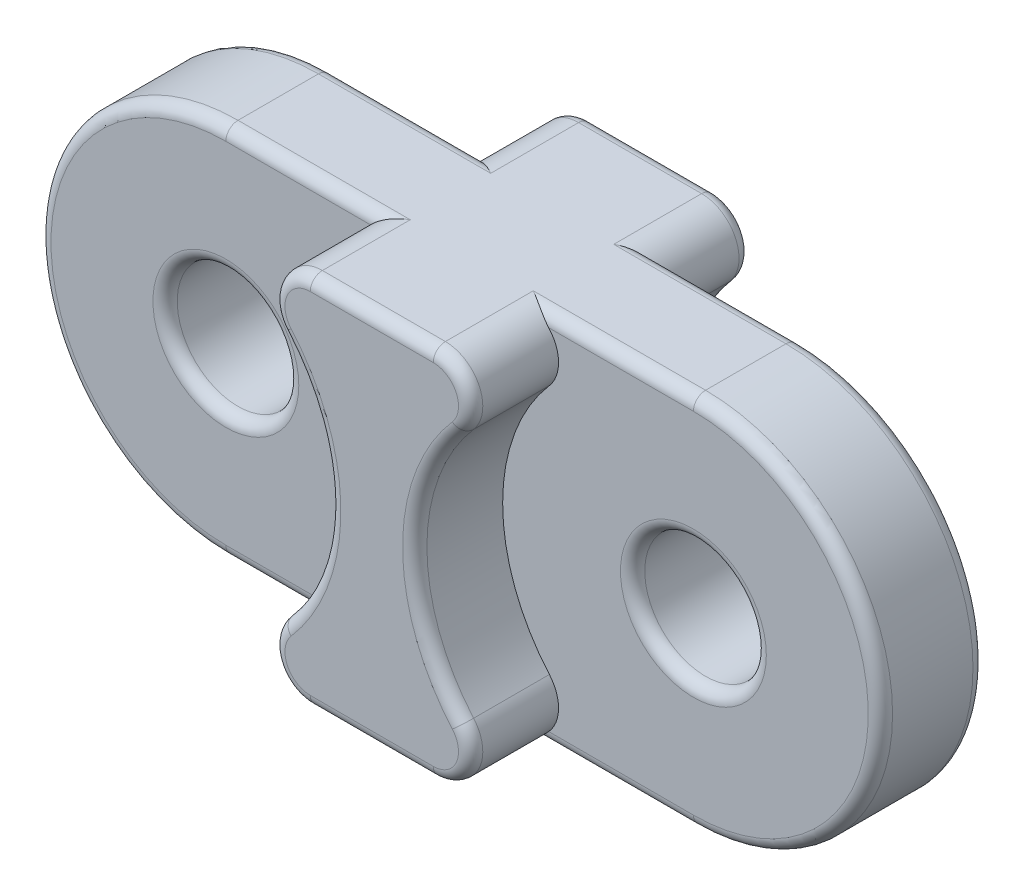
ISO-10303-21;
HEADER;
FILE_DESCRIPTION(('STEP AP214'),'2;1');
FILE_NAME('part.step','',(''),(''),'','','');
FILE_SCHEMA(('AUTOMOTIVE_DESIGN { 1 0 10303 214 1 1 1 1 }'));
ENDSEC;
DATA;
#1=APPLICATION_CONTEXT('core data for automotive mechanical design processes');
#2=APPLICATION_PROTOCOL_DEFINITION('international standard','automotive_design',2000,#1);
#3=PRODUCT_CONTEXT('',#1,'mechanical');
#4=PRODUCT('Part','Part','',(#3));
#5=PRODUCT_RELATED_PRODUCT_CATEGORY('part','',(#4));
#6=PRODUCT_DEFINITION_FORMATION('','',#4);
#7=PRODUCT_DEFINITION_CONTEXT('part definition',#1,'design');
#8=PRODUCT_DEFINITION('design','',#6,#7);
#9=PRODUCT_DEFINITION_SHAPE('','',#8);
#10=(LENGTH_UNIT() NAMED_UNIT(*) SI_UNIT(.MILLI.,.METRE.));
#11=(NAMED_UNIT(*) PLANE_ANGLE_UNIT() SI_UNIT($,.RADIAN.));
#12=(NAMED_UNIT(*) SI_UNIT($,.STERADIAN.) SOLID_ANGLE_UNIT());
#13=UNCERTAINTY_MEASURE_WITH_UNIT(LENGTH_MEASURE(1.E-05),#10,'distance_accuracy_value','');
#14=(GEOMETRIC_REPRESENTATION_CONTEXT(3) GLOBAL_UNCERTAINTY_ASSIGNED_CONTEXT((#13)) GLOBAL_UNIT_ASSIGNED_CONTEXT((#10,
#11,#12)) REPRESENTATION_CONTEXT('',''));
#15=CARTESIAN_POINT('',(0.,0.,0.));
#16=DIRECTION('',(0.,0.,1.));
#17=DIRECTION('',(1.,0.,0.));
#18=AXIS2_PLACEMENT_3D('',#15,#16,#17);
#19=CARTESIAN_POINT('',(0.,-12.7,9.525));
#20=DIRECTION('',(0.,1.,0.));
#21=DIRECTION('',(0.,0.,1.));
#22=AXIS2_PLACEMENT_3D('',#19,#20,#21);
#23=PLANE('',#22);
#24=DIRECTION('',(0.,0.,1.));
#25=VECTOR('',#24,1.);
#26=CARTESIAN_POINT('',(20.0522037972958,-12.7,9.525));
#27=LINE('',#26,#25);
#28=CARTESIAN_POINT('',(20.0522037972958,-12.7,2.7305));
#29=VERTEX_POINT('',#28);
#30=CARTESIAN_POINT('',(20.0522037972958,-12.7,8.6995));
#31=VERTEX_POINT('',#30);
#32=EDGE_CURVE('E302',#29,#31,#27,.T.);
#33=ORIENTED_EDGE('',*,*,#32,.T.);
#34=DIRECTION('',(1.,0.,0.));
#35=VECTOR('',#34,1.);
#36=CARTESIAN_POINT('',(11.6977962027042,-12.7,8.6995));
#37=LINE('',#36,#35);
#38=CARTESIAN_POINT('',(11.6977962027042,-12.7,8.6995));
#39=VERTEX_POINT('',#38);
#40=EDGE_CURVE('E421',#31,#39,#37,.F.);
#41=ORIENTED_EDGE('',*,*,#40,.T.);
#42=DIRECTION('',(0.,0.,1.));
#43=VECTOR('',#42,1.);
#44=CARTESIAN_POINT('',(11.6977962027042,-12.7,9.525));
#45=LINE('',#44,#43);
#46=CARTESIAN_POINT('',(11.6977962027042,-12.7,2.7305));
#47=VERTEX_POINT('',#46);
#48=EDGE_CURVE('E762',#39,#47,#45,.F.);
#49=ORIENTED_EDGE('',*,*,#48,.T.);
#50=DIRECTION('',(1.,0.,0.));
#51=VECTOR('',#50,1.);
#52=CARTESIAN_POINT('',(0.,-12.7,2.7305));
#53=LINE('',#52,#51);
#54=CARTESIAN_POINT('',(0.,-12.7,2.7305));
#55=VERTEX_POINT('',#54);
#56=EDGE_CURVE('E409',#47,#55,#53,.F.);
#57=ORIENTED_EDGE('',*,*,#56,.T.);
#58=DIRECTION('',(0.,0.,-1.));
#59=VECTOR('',#58,1.);
#60=CARTESIAN_POINT('',(0.,-12.7,9.525));
#61=LINE('',#60,#59);
#62=CARTESIAN_POINT('',(0.,-12.7,-2.7305));
#63=VERTEX_POINT('',#62);
#64=EDGE_CURVE('E760',#55,#63,#61,.T.);
#65=ORIENTED_EDGE('',*,*,#64,.T.);
#66=DIRECTION('',(-1.,0.,0.));
#67=VECTOR('',#66,1.);
#68=CARTESIAN_POINT('',(11.6977962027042,-12.7,-2.7305));
#69=LINE('',#68,#67);
#70=CARTESIAN_POINT('',(11.6977962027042,-12.7,-2.7305));
#71=VERTEX_POINT('',#70);
#72=EDGE_CURVE('E413',#63,#71,#69,.F.);
#73=ORIENTED_EDGE('',*,*,#72,.T.);
#74=DIRECTION('',(0.,0.,1.));
#75=VECTOR('',#74,1.);
#76=CARTESIAN_POINT('',(11.6977962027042,-12.7,-9.525));
#77=LINE('',#76,#75);
#78=CARTESIAN_POINT('',(11.6977962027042,-12.7,-8.6995));
#79=VERTEX_POINT('',#78);
#80=EDGE_CURVE('E768',#71,#79,#77,.F.);
#81=ORIENTED_EDGE('',*,*,#80,.T.);
#82=DIRECTION('',(1.,0.,0.));
#83=VECTOR('',#82,1.);
#84=CARTESIAN_POINT('',(0.,-12.7,-8.6995));
#85=LINE('',#84,#83);
#86=CARTESIAN_POINT('',(20.0522037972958,-12.7,-8.6995));
#87=VERTEX_POINT('',#86);
#88=EDGE_CURVE('E419',#79,#87,#85,.T.);
#89=ORIENTED_EDGE('',*,*,#88,.T.);
#90=DIRECTION('',(0.,0.,1.));
#91=VECTOR('',#90,1.);
#92=CARTESIAN_POINT('',(20.0522037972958,-12.7,-3.556));
#93=LINE('',#92,#91);
#94=CARTESIAN_POINT('',(20.0522037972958,-12.7,-2.7305));
#95=VERTEX_POINT('',#94);
#96=EDGE_CURVE('E307',#87,#95,#93,.T.);
#97=ORIENTED_EDGE('',*,*,#96,.T.);
#98=DIRECTION('',(-1.,0.,0.));
#99=VECTOR('',#98,1.);
#100=CARTESIAN_POINT('',(31.75,-12.7,-2.7305));
#101=LINE('',#100,#99);
#102=CARTESIAN_POINT('',(31.75,-12.7,-2.7305));
#103=VERTEX_POINT('',#102);
#104=EDGE_CURVE('E411',#95,#103,#101,.F.);
#105=ORIENTED_EDGE('',*,*,#104,.T.);
#106=DIRECTION('',(0.,0.,-1.));
#107=VECTOR('',#106,1.);
#108=CARTESIAN_POINT('',(31.75,-12.7,9.525));
#109=LINE('',#108,#107);
#110=CARTESIAN_POINT('',(31.75,-12.7,2.7305));
#111=VERTEX_POINT('',#110);
#112=EDGE_CURVE('E757',#111,#103,#109,.T.);
#113=ORIENTED_EDGE('',*,*,#112,.F.);
#114=DIRECTION('',(1.,0.,0.));
#115=VECTOR('',#114,1.);
#116=CARTESIAN_POINT('',(20.0522037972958,-12.7,2.7305));
#117=LINE('',#116,#115);
#118=EDGE_CURVE('E416',#111,#29,#117,.F.);
#119=ORIENTED_EDGE('',*,*,#118,.T.);
#120=EDGE_LOOP('',(#33,#41,#49,#57,#65,#73,#81,#89,#97,#105,#113,#119));
#121=FACE_BOUND('',#120,.T.);
#122=ADVANCED_FACE('F37',(#121),#23,.F.);
#123=CARTESIAN_POINT('',(0.,12.7,9.525));
#124=DIRECTION('',(0.,-1.,0.));
#125=DIRECTION('',(0.,0.,-1.));
#126=AXIS2_PLACEMENT_3D('',#123,#124,#125);
#127=PLANE('',#126);
#128=DIRECTION('',(0.,0.,1.));
#129=VECTOR('',#128,1.);
#130=CARTESIAN_POINT('',(11.6977962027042,12.7,9.525));
#131=LINE('',#130,#129);
#132=CARTESIAN_POINT('',(11.6977962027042,12.7,2.7305));
#133=VERTEX_POINT('',#132);
#134=CARTESIAN_POINT('',(11.6977962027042,12.7,8.6995));
#135=VERTEX_POINT('',#134);
#136=EDGE_CURVE('E327',#133,#135,#131,.T.);
#137=ORIENTED_EDGE('',*,*,#136,.T.);
#138=DIRECTION('',(-1.,0.,0.));
#139=VECTOR('',#138,1.);
#140=CARTESIAN_POINT('',(20.0522037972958,12.7,8.6995));
#141=LINE('',#140,#139);
#142=CARTESIAN_POINT('',(20.0522037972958,12.7,8.6995));
#143=VERTEX_POINT('',#142);
#144=EDGE_CURVE('E402',#135,#143,#141,.F.);
#145=ORIENTED_EDGE('',*,*,#144,.T.);
#146=DIRECTION('',(0.,0.,1.));
#147=VECTOR('',#146,1.);
#148=CARTESIAN_POINT('',(20.0522037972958,12.7,9.525));
#149=LINE('',#148,#147);
#150=CARTESIAN_POINT('',(20.0522037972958,12.7,2.7305));
#151=VERTEX_POINT('',#150);
#152=EDGE_CURVE('E330',#143,#151,#149,.F.);
#153=ORIENTED_EDGE('',*,*,#152,.T.);
#154=DIRECTION('',(-1.,0.,0.));
#155=VECTOR('',#154,1.);
#156=CARTESIAN_POINT('',(31.75,12.7,2.7305));
#157=LINE('',#156,#155);
#158=CARTESIAN_POINT('',(31.75,12.7,2.7305));
#159=VERTEX_POINT('',#158);
#160=EDGE_CURVE('E398',#151,#159,#157,.F.);
#161=ORIENTED_EDGE('',*,*,#160,.T.);
#162=DIRECTION('',(0.,0.,-1.));
#163=VECTOR('',#162,1.);
#164=CARTESIAN_POINT('',(31.75,12.7,9.525));
#165=LINE('',#164,#163);
#166=CARTESIAN_POINT('',(31.75,12.7,-2.7305));
#167=VERTEX_POINT('',#166);
#168=EDGE_CURVE('E668',#159,#167,#165,.T.);
#169=ORIENTED_EDGE('',*,*,#168,.T.);
#170=DIRECTION('',(1.,0.,0.));
#171=VECTOR('',#170,1.);
#172=CARTESIAN_POINT('',(20.0522037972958,12.7,-2.7305));
#173=LINE('',#172,#171);
#174=CARTESIAN_POINT('',(20.0522037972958,12.7,-2.7305));
#175=VERTEX_POINT('',#174);
#176=EDGE_CURVE('E393',#167,#175,#173,.F.);
#177=ORIENTED_EDGE('',*,*,#176,.T.);
#178=DIRECTION('',(0.,0.,1.));
#179=VECTOR('',#178,1.);
#180=CARTESIAN_POINT('',(20.0522037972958,12.7,-9.525));
#181=LINE('',#180,#179);
#182=CARTESIAN_POINT('',(20.0522037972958,12.7,-8.6995));
#183=VERTEX_POINT('',#182);
#184=EDGE_CURVE('E332',#175,#183,#181,.F.);
#185=ORIENTED_EDGE('',*,*,#184,.T.);
#186=DIRECTION('',(-1.,0.,0.));
#187=VECTOR('',#186,1.);
#188=CARTESIAN_POINT('',(0.,12.7,-8.6995));
#189=LINE('',#188,#187);
#190=CARTESIAN_POINT('',(11.6977962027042,12.7,-8.6995));
#191=VERTEX_POINT('',#190);
#192=EDGE_CURVE('E400',#183,#191,#189,.T.);
#193=ORIENTED_EDGE('',*,*,#192,.T.);
#194=DIRECTION('',(0.,0.,1.));
#195=VECTOR('',#194,1.);
#196=CARTESIAN_POINT('',(11.6977962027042,12.7,-3.556));
#197=LINE('',#196,#195);
#198=CARTESIAN_POINT('',(11.6977962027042,12.7,-2.7305));
#199=VERTEX_POINT('',#198);
#200=EDGE_CURVE('E325',#191,#199,#197,.T.);
#201=ORIENTED_EDGE('',*,*,#200,.T.);
#202=DIRECTION('',(1.,0.,0.));
#203=VECTOR('',#202,1.);
#204=CARTESIAN_POINT('',(0.,12.7,-2.7305));
#205=LINE('',#204,#203);
#206=CARTESIAN_POINT('',(0.,12.7,-2.7305));
#207=VERTEX_POINT('',#206);
#208=EDGE_CURVE('E396',#199,#207,#205,.F.);
#209=ORIENTED_EDGE('',*,*,#208,.T.);
#210=DIRECTION('',(0.,0.,-1.));
#211=VECTOR('',#210,1.);
#212=CARTESIAN_POINT('',(0.,12.7,9.525));
#213=LINE('',#212,#211);
#214=CARTESIAN_POINT('',(0.,12.7,2.7305));
#215=VERTEX_POINT('',#214);
#216=EDGE_CURVE('E295',#215,#207,#213,.T.);
#217=ORIENTED_EDGE('',*,*,#216,.F.);
#218=DIRECTION('',(-1.,0.,0.));
#219=VECTOR('',#218,1.);
#220=CARTESIAN_POINT('',(11.6977962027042,12.7,2.7305));
#221=LINE('',#220,#219);
#222=EDGE_CURVE('E390',#215,#133,#221,.F.);
#223=ORIENTED_EDGE('',*,*,#222,.T.);
#224=EDGE_LOOP('',(#137,#145,#153,#161,#169,#177,#185,#193,#201,#209,#217,#223));
#225=FACE_BOUND('',#224,.T.);
#226=ADVANCED_FACE('F639',(#225),#127,.F.);
#227=CARTESIAN_POINT('',(0.,0.,-9.525));
#228=DIRECTION('',(0.,0.,1.));
#229=DIRECTION('',(1.,0.,0.));
#230=AXIS2_PLACEMENT_3D('',#227,#228,#229);
#231=PLANE('',#230);
#232=DIRECTION('',(-1.,0.,0.));
#233=VECTOR('',#232,1.);
#234=CARTESIAN_POINT('',(0.,11.8745,-9.525));
#235=LINE('',#234,#233);
#236=CARTESIAN_POINT('',(11.6977962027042,11.8745,-9.525));
#237=VERTEX_POINT('',#236);
#238=CARTESIAN_POINT('',(20.0522037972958,11.8745,-9.525));
#239=VERTEX_POINT('',#238);
#240=EDGE_CURVE('E461',#237,#239,#235,.F.);
#241=ORIENTED_EDGE('',*,*,#240,.T.);
#242=CARTESIAN_POINT('',(20.0522037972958,10.16,-9.525));
#243=DIRECTION('',(0.,0.,1.));
#244=DIRECTION('',(1.,0.,0.));
#245=AXIS2_PLACEMENT_3D('',#242,#243,#244);
#246=CIRCLE('',#245,1.7145);
#247=CARTESIAN_POINT('',(21.3466320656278,9.03573770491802,-9.525));
#248=VERTEX_POINT('',#247);
#249=EDGE_CURVE('E463',#239,#248,#246,.F.);
#250=ORIENTED_EDGE('',*,*,#249,.T.);
#251=CARTESIAN_POINT('',(31.75,0.,-9.525));
#252=DIRECTION('',(0.,0.,1.));
#253=DIRECTION('',(1.,0.,0.));
#254=AXIS2_PLACEMENT_3D('',#251,#252,#253);
#255=CIRCLE('',#254,13.7795);
#256=CARTESIAN_POINT('',(21.3466320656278,-9.03573770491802,-9.525));
#257=VERTEX_POINT('',#256);
#258=EDGE_CURVE('E449',#248,#257,#255,.T.);
#259=ORIENTED_EDGE('',*,*,#258,.T.);
#260=CARTESIAN_POINT('',(20.0522037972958,-10.16,-9.525));
#261=DIRECTION('',(0.,0.,1.));
#262=DIRECTION('',(1.,0.,0.));
#263=AXIS2_PLACEMENT_3D('',#260,#261,#262);
#264=CIRCLE('',#263,1.7145);
#265=CARTESIAN_POINT('',(20.0522037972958,-11.8745,-9.525));
#266=VERTEX_POINT('',#265);
#267=EDGE_CURVE('E451',#257,#266,#264,.F.);
#268=ORIENTED_EDGE('',*,*,#267,.T.);
#269=DIRECTION('',(1.,0.,0.));
#270=VECTOR('',#269,1.);
#271=CARTESIAN_POINT('',(0.,-11.8745,-9.525));
#272=LINE('',#271,#270);
#273=CARTESIAN_POINT('',(11.6977962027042,-11.8745,-9.525));
#274=VERTEX_POINT('',#273);
#275=EDGE_CURVE('E453',#266,#274,#272,.F.);
#276=ORIENTED_EDGE('',*,*,#275,.T.);
#277=CARTESIAN_POINT('',(11.6977962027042,-10.16,-9.525));
#278=DIRECTION('',(0.,0.,1.));
#279=DIRECTION('',(1.,0.,0.));
#280=AXIS2_PLACEMENT_3D('',#277,#278,#279);
#281=CIRCLE('',#280,1.7145);
#282=CARTESIAN_POINT('',(10.4033679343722,-9.03573770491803,-9.525));
#283=VERTEX_POINT('',#282);
#284=EDGE_CURVE('E455',#274,#283,#281,.F.);
#285=ORIENTED_EDGE('',*,*,#284,.T.);
#286=CARTESIAN_POINT('',(0.,0.,-9.525));
#287=DIRECTION('',(0.,0.,1.));
#288=DIRECTION('',(1.,0.,0.));
#289=AXIS2_PLACEMENT_3D('',#286,#287,#288);
#290=CIRCLE('',#289,13.7795);
#291=CARTESIAN_POINT('',(10.4033679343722,9.03573770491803,-9.525));
#292=VERTEX_POINT('',#291);
#293=EDGE_CURVE('E457',#283,#292,#290,.T.);
#294=ORIENTED_EDGE('',*,*,#293,.T.);
#295=CARTESIAN_POINT('',(11.6977962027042,10.16,-9.525));
#296=DIRECTION('',(0.,0.,1.));
#297=DIRECTION('',(1.,0.,0.));
#298=AXIS2_PLACEMENT_3D('',#295,#296,#297);
#299=CIRCLE('',#298,1.7145);
#300=EDGE_CURVE('E459',#292,#237,#299,.F.);
#301=ORIENTED_EDGE('',*,*,#300,.T.);
#302=EDGE_LOOP('',(#241,#250,#259,#268,#276,#285,#294,#301));
#303=FACE_BOUND('',#302,.T.);
#304=ADVANCED_FACE('F645',(#303),#231,.F.);
#305=CARTESIAN_POINT('',(0.,0.,9.525));
#306=DIRECTION('',(0.,0.,-1.));
#307=DIRECTION('',(-1.,0.,0.));
#308=AXIS2_PLACEMENT_3D('',#305,#306,#307);
#309=CYLINDRICAL_SURFACE('',#308,12.7);
#310=ORIENTED_EDGE('',*,*,#216,.T.);
#311=CARTESIAN_POINT('',(0.,0.,-2.7305));
#312=DIRECTION('',(0.,0.,-1.));
#313=DIRECTION('',(-1.,0.,0.));
#314=AXIS2_PLACEMENT_3D('',#311,#312,#313);
#315=CIRCLE('',#314,12.7);
#316=EDGE_CURVE('E492',#207,#63,#315,.F.);
#317=ORIENTED_EDGE('',*,*,#316,.T.);
#318=ORIENTED_EDGE('',*,*,#64,.F.);
#319=CARTESIAN_POINT('',(0.,0.,2.7305));
#320=DIRECTION('',(0.,0.,1.));
#321=DIRECTION('',(1.,0.,0.));
#322=AXIS2_PLACEMENT_3D('',#319,#320,#321);
#323=CIRCLE('',#322,12.7);
#324=EDGE_CURVE('E490',#55,#215,#323,.F.);
#325=ORIENTED_EDGE('',*,*,#324,.T.);
#326=EDGE_LOOP('',(#310,#317,#318,#325));
#327=FACE_BOUND('',#326,.T.);
#328=ADVANCED_FACE('F650',(#327),#309,.T.);
#329=CARTESIAN_POINT('',(31.75,0.,9.525));
#330=DIRECTION('',(0.,0.,-1.));
#331=DIRECTION('',(-1.,0.,0.));
#332=AXIS2_PLACEMENT_3D('',#329,#330,#331);
#333=CYLINDRICAL_SURFACE('',#332,12.7);
#334=ORIENTED_EDGE('',*,*,#168,.F.);
#335=CARTESIAN_POINT('',(31.75,0.,2.7305));
#336=DIRECTION('',(0.,0.,1.));
#337=DIRECTION('',(1.,0.,0.));
#338=AXIS2_PLACEMENT_3D('',#335,#336,#337);
#339=CIRCLE('',#338,12.7);
#340=EDGE_CURVE('E488',#159,#111,#339,.F.);
#341=ORIENTED_EDGE('',*,*,#340,.T.);
#342=ORIENTED_EDGE('',*,*,#112,.T.);
#343=CARTESIAN_POINT('',(31.75,0.,-2.7305));
#344=DIRECTION('',(0.,0.,-1.));
#345=DIRECTION('',(-1.,0.,0.));
#346=AXIS2_PLACEMENT_3D('',#343,#344,#345);
#347=CIRCLE('',#346,12.7);
#348=EDGE_CURVE('E486',#103,#167,#347,.F.);
#349=ORIENTED_EDGE('',*,*,#348,.T.);
#350=EDGE_LOOP('',(#334,#341,#342,#349));
#351=FACE_BOUND('',#350,.T.);
#352=ADVANCED_FACE('F649',(#351),#333,.T.);
#353=CARTESIAN_POINT('',(0.,0.,9.525));
#354=DIRECTION('',(0.,0.,1.));
#355=DIRECTION('',(1.,0.,0.));
#356=AXIS2_PLACEMENT_3D('',#353,#354,#355);
#357=PLANE('',#356);
#358=CARTESIAN_POINT('',(0.,0.,9.525));
#359=DIRECTION('',(0.,0.,1.));
#360=DIRECTION('',(1.,0.,0.));
#361=AXIS2_PLACEMENT_3D('',#358,#359,#360);
#362=CIRCLE('',#361,13.7795);
#363=CARTESIAN_POINT('',(10.4033679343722,9.03573770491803,9.525));
#364=VERTEX_POINT('',#363);
#365=CARTESIAN_POINT('',(10.4033679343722,-9.03573770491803,9.525));
#366=VERTEX_POINT('',#365);
#367=EDGE_CURVE('E378',#364,#366,#362,.F.);
#368=ORIENTED_EDGE('',*,*,#367,.T.);
#369=CARTESIAN_POINT('',(11.6977962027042,-10.16,9.525));
#370=DIRECTION('',(0.,0.,1.));
#371=DIRECTION('',(1.,0.,0.));
#372=AXIS2_PLACEMENT_3D('',#369,#370,#371);
#373=CIRCLE('',#372,1.7145);
#374=CARTESIAN_POINT('',(11.6977962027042,-11.8745,9.525));
#375=VERTEX_POINT('',#374);
#376=EDGE_CURVE('E380',#366,#375,#373,.T.);
#377=ORIENTED_EDGE('',*,*,#376,.T.);
#378=DIRECTION('',(1.,0.,0.));
#379=VECTOR('',#378,1.);
#380=CARTESIAN_POINT('',(20.0522037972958,-11.8745,9.525));
#381=LINE('',#380,#379);
#382=CARTESIAN_POINT('',(20.0522037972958,-11.8745,9.525));
#383=VERTEX_POINT('',#382);
#384=EDGE_CURVE('E366',#375,#383,#381,.T.);
#385=ORIENTED_EDGE('',*,*,#384,.T.);
#386=CARTESIAN_POINT('',(20.0522037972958,-10.16,9.525));
#387=DIRECTION('',(0.,0.,1.));
#388=DIRECTION('',(1.,0.,0.));
#389=AXIS2_PLACEMENT_3D('',#386,#387,#388);
#390=CIRCLE('',#389,1.7145);
#391=CARTESIAN_POINT('',(21.3466320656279,-9.03573770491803,9.525));
#392=VERTEX_POINT('',#391);
#393=EDGE_CURVE('E368',#383,#392,#390,.T.);
#394=ORIENTED_EDGE('',*,*,#393,.T.);
#395=CARTESIAN_POINT('',(31.75,0.,9.525));
#396=DIRECTION('',(0.,0.,1.));
#397=DIRECTION('',(1.,0.,0.));
#398=AXIS2_PLACEMENT_3D('',#395,#396,#397);
#399=CIRCLE('',#398,13.7795);
#400=CARTESIAN_POINT('',(21.3466320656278,9.03573770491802,9.525));
#401=VERTEX_POINT('',#400);
#402=EDGE_CURVE('E370',#392,#401,#399,.F.);
#403=ORIENTED_EDGE('',*,*,#402,.T.);
#404=CARTESIAN_POINT('',(20.0522037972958,10.16,9.525));
#405=DIRECTION('',(0.,0.,1.));
#406=DIRECTION('',(1.,0.,0.));
#407=AXIS2_PLACEMENT_3D('',#404,#405,#406);
#408=CIRCLE('',#407,1.7145);
#409=CARTESIAN_POINT('',(20.0522037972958,11.8745,9.525));
#410=VERTEX_POINT('',#409);
#411=EDGE_CURVE('E372',#401,#410,#408,.T.);
#412=ORIENTED_EDGE('',*,*,#411,.T.);
#413=DIRECTION('',(-1.,0.,0.));
#414=VECTOR('',#413,1.);
#415=CARTESIAN_POINT('',(11.6977962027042,11.8745,9.525));
#416=LINE('',#415,#414);
#417=CARTESIAN_POINT('',(11.6977962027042,11.8745,9.525));
#418=VERTEX_POINT('',#417);
#419=EDGE_CURVE('E374',#410,#418,#416,.T.);
#420=ORIENTED_EDGE('',*,*,#419,.T.);
#421=CARTESIAN_POINT('',(11.6977962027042,10.16,9.525));
#422=DIRECTION('',(0.,0.,1.));
#423=DIRECTION('',(1.,0.,0.));
#424=AXIS2_PLACEMENT_3D('',#421,#422,#423);
#425=CIRCLE('',#424,1.7145);
#426=EDGE_CURVE('E376',#418,#364,#425,.T.);
#427=ORIENTED_EDGE('',*,*,#426,.T.);
#428=EDGE_LOOP('',(#368,#377,#385,#394,#403,#412,#420,#427));
#429=FACE_BOUND('',#428,.T.);
#430=ADVANCED_FACE('F657',(#429),#357,.T.);
#431=CARTESIAN_POINT('',(31.75,0.,3.556));
#432=DIRECTION('',(0.,0.,1.));
#433=DIRECTION('',(1.,0.,0.));
#434=AXIS2_PLACEMENT_3D('',#431,#432,#433);
#435=PLANE('',#434);
#436=CARTESIAN_POINT('',(31.75,0.,3.556));
#437=DIRECTION('',(0.,0.,1.));
#438=DIRECTION('',(1.,0.,0.));
#439=AXIS2_PLACEMENT_3D('',#436,#437,#438);
#440=CIRCLE('',#439,4.953);
#441=CARTESIAN_POINT('',(36.703,0.,3.556));
#442=VERTEX_POINT('',#441);
#443=EDGE_CURVE('E483',#442,#442,#440,.F.);
#444=ORIENTED_EDGE('',*,*,#443,.T.);
#445=EDGE_LOOP('',(#444));
#446=FACE_BOUND('',#445,.T.);
#447=CARTESIAN_POINT('',(20.0522037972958,-10.16,3.556));
#448=DIRECTION('',(0.,0.,1.));
#449=DIRECTION('',(1.,0.,0.));
#450=AXIS2_PLACEMENT_3D('',#447,#448,#449);
#451=CIRCLE('',#450,2.54);
#452=CARTESIAN_POINT('',(21.9698753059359,-8.49442622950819,3.556));
#453=VERTEX_POINT('',#452);
#454=CARTESIAN_POINT('',(21.9262608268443,-11.8745,3.556));
#455=VERTEX_POINT('',#454);
#456=EDGE_CURVE('E335',#453,#455,#451,.F.);
#457=ORIENTED_EDGE('',*,*,#456,.T.);
#458=DIRECTION('',(1.,0.,0.));
#459=VECTOR('',#458,1.);
#460=CARTESIAN_POINT('',(31.75,-11.8745,3.556));
#461=LINE('',#460,#459);
#462=CARTESIAN_POINT('',(31.75,-11.8745,3.556));
#463=VERTEX_POINT('',#462);
#464=EDGE_CURVE('E55',#455,#463,#461,.T.);
#465=ORIENTED_EDGE('',*,*,#464,.T.);
#466=CARTESIAN_POINT('',(31.75,0.,3.556));
#467=DIRECTION('',(0.,0.,1.));
#468=DIRECTION('',(1.,0.,0.));
#469=AXIS2_PLACEMENT_3D('',#466,#467,#468);
#470=CIRCLE('',#469,11.8745);
#471=CARTESIAN_POINT('',(31.75,11.8745,3.556));
#472=VERTEX_POINT('',#471);
#473=EDGE_CURVE('E480',#463,#472,#470,.T.);
#474=ORIENTED_EDGE('',*,*,#473,.T.);
#475=DIRECTION('',(-1.,0.,0.));
#476=VECTOR('',#475,1.);
#477=CARTESIAN_POINT('',(20.0522037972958,11.8745,3.556));
#478=LINE('',#477,#476);
#479=CARTESIAN_POINT('',(21.9262608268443,11.8745,3.556));
#480=VERTEX_POINT('',#479);
#481=EDGE_CURVE('E280',#472,#480,#478,.T.);
#482=ORIENTED_EDGE('',*,*,#481,.T.);
#483=CARTESIAN_POINT('',(20.0522037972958,10.16,3.556));
#484=DIRECTION('',(0.,0.,1.));
#485=DIRECTION('',(1.,0.,0.));
#486=AXIS2_PLACEMENT_3D('',#483,#484,#485);
#487=CIRCLE('',#486,2.54);
#488=CARTESIAN_POINT('',(21.9698753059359,8.49442622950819,3.556));
#489=VERTEX_POINT('',#488);
#490=EDGE_CURVE('E275',#480,#489,#487,.F.);
#491=ORIENTED_EDGE('',*,*,#490,.T.);
#492=CARTESIAN_POINT('',(31.75,0.,3.556));
#493=DIRECTION('',(0.,0.,1.));
#494=DIRECTION('',(1.,0.,0.));
#495=AXIS2_PLACEMENT_3D('',#492,#493,#494);
#496=CIRCLE('',#495,12.954);
#497=EDGE_CURVE('E278',#489,#453,#496,.T.);
#498=ORIENTED_EDGE('',*,*,#497,.T.);
#499=EDGE_LOOP('',(#457,#465,#474,#482,#491,#498));
#500=FACE_BOUND('',#499,.T.);
#501=ADVANCED_FACE('F277',(#446,#500),#435,.T.);
#502=CARTESIAN_POINT('',(31.75,0.,3.556));
#503=DIRECTION('',(0.,0.,1.));
#504=DIRECTION('',(1.,0.,0.));
#505=AXIS2_PLACEMENT_3D('',#502,#503,#504);
#506=CYLINDRICAL_SURFACE('',#505,12.954);
#507=DIRECTION('',(0.,0.,1.));
#508=VECTOR('',#507,1.);
#509=CARTESIAN_POINT('',(21.9698753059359,8.49442622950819,3.556));
#510=LINE('',#509,#508);
#511=CARTESIAN_POINT('',(21.9698753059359,8.49442622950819,8.6995));
#512=VERTEX_POINT('',#511);
#513=EDGE_CURVE('E291',#489,#512,#510,.T.);
#514=ORIENTED_EDGE('',*,*,#513,.T.);
#515=CARTESIAN_POINT('',(31.75,0.,8.6995));
#516=DIRECTION('',(0.,0.,1.));
#517=DIRECTION('',(1.,0.,0.));
#518=AXIS2_PLACEMENT_3D('',#515,#516,#517);
#519=CIRCLE('',#518,12.954);
#520=CARTESIAN_POINT('',(21.9698753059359,-8.49442622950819,8.6995));
#521=VERTEX_POINT('',#520);
#522=EDGE_CURVE('E405',#512,#521,#519,.T.);
#523=ORIENTED_EDGE('',*,*,#522,.T.);
#524=DIRECTION('',(0.,0.,1.));
#525=VECTOR('',#524,1.);
#526=CARTESIAN_POINT('',(21.9698753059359,-8.49442622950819,3.556));
#527=LINE('',#526,#525);
#528=EDGE_CURVE('E294',#521,#453,#527,.F.);
#529=ORIENTED_EDGE('',*,*,#528,.T.);
#530=ORIENTED_EDGE('',*,*,#497,.F.);
#531=EDGE_LOOP('',(#514,#523,#529,#530));
#532=FACE_BOUND('',#531,.T.);
#533=ADVANCED_FACE('F290',(#532),#506,.F.);
#534=CARTESIAN_POINT('',(0.,0.,3.556));
#535=DIRECTION('',(0.,0.,1.));
#536=DIRECTION('',(1.,0.,0.));
#537=AXIS2_PLACEMENT_3D('',#534,#535,#536);
#538=PLANE('',#537);
#539=CARTESIAN_POINT('',(0.,0.,3.556));
#540=DIRECTION('',(0.,0.,1.));
#541=DIRECTION('',(1.,0.,0.));
#542=AXIS2_PLACEMENT_3D('',#539,#540,#541);
#543=CIRCLE('',#542,4.953);
#544=CARTESIAN_POINT('',(4.953,0.,3.556));
#545=VERTEX_POINT('',#544);
#546=EDGE_CURVE('E436',#545,#545,#543,.F.);
#547=ORIENTED_EDGE('',*,*,#546,.T.);
#548=EDGE_LOOP('',(#547));
#549=FACE_BOUND('',#548,.T.);
#550=CARTESIAN_POINT('',(0.,0.,3.556));
#551=DIRECTION('',(0.,0.,1.));
#552=DIRECTION('',(1.,0.,0.));
#553=AXIS2_PLACEMENT_3D('',#550,#551,#552);
#554=CIRCLE('',#553,11.8745);
#555=CARTESIAN_POINT('',(0.,11.8745,3.556));
#556=VERTEX_POINT('',#555);
#557=CARTESIAN_POINT('',(0.,-11.8745,3.556));
#558=VERTEX_POINT('',#557);
#559=EDGE_CURVE('E431',#556,#558,#554,.T.);
#560=ORIENTED_EDGE('',*,*,#559,.T.);
#561=DIRECTION('',(1.,0.,0.));
#562=VECTOR('',#561,1.);
#563=CARTESIAN_POINT('',(11.6977962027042,-11.8745,3.556));
#564=LINE('',#563,#562);
#565=CARTESIAN_POINT('',(9.82373917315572,-11.8745,3.556));
#566=VERTEX_POINT('',#565);
#567=EDGE_CURVE('E433',#558,#566,#564,.T.);
#568=ORIENTED_EDGE('',*,*,#567,.T.);
#569=CARTESIAN_POINT('',(11.6977962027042,-10.16,3.556));
#570=DIRECTION('',(0.,0.,1.));
#571=DIRECTION('',(1.,0.,0.));
#572=AXIS2_PLACEMENT_3D('',#569,#570,#571);
#573=CIRCLE('',#572,2.54);
#574=CARTESIAN_POINT('',(9.78012469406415,-8.49442622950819,3.556));
#575=VERTEX_POINT('',#574);
#576=EDGE_CURVE('E342',#566,#575,#573,.F.);
#577=ORIENTED_EDGE('',*,*,#576,.T.);
#578=CARTESIAN_POINT('',(0.,0.,3.556));
#579=DIRECTION('',(0.,0.,1.));
#580=DIRECTION('',(1.,0.,0.));
#581=AXIS2_PLACEMENT_3D('',#578,#579,#580);
#582=CIRCLE('',#581,12.954);
#583=CARTESIAN_POINT('',(9.78012469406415,8.49442622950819,3.556));
#584=VERTEX_POINT('',#583);
#585=EDGE_CURVE('E296',#575,#584,#582,.T.);
#586=ORIENTED_EDGE('',*,*,#585,.T.);
#587=CARTESIAN_POINT('',(11.6977962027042,10.16,3.556));
#588=DIRECTION('',(0.,0.,1.));
#589=DIRECTION('',(1.,0.,0.));
#590=AXIS2_PLACEMENT_3D('',#587,#588,#589);
#591=CIRCLE('',#590,2.54);
#592=CARTESIAN_POINT('',(9.82373917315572,11.8745,3.556));
#593=VERTEX_POINT('',#592);
#594=EDGE_CURVE('E285',#584,#593,#591,.F.);
#595=ORIENTED_EDGE('',*,*,#594,.T.);
#596=DIRECTION('',(-1.,0.,0.));
#597=VECTOR('',#596,1.);
#598=CARTESIAN_POINT('',(0.,11.8745,3.556));
#599=LINE('',#598,#597);
#600=EDGE_CURVE('E429',#593,#556,#599,.T.);
#601=ORIENTED_EDGE('',*,*,#600,.T.);
#602=EDGE_LOOP('',(#560,#568,#577,#586,#595,#601));
#603=FACE_BOUND('',#602,.T.);
#604=ADVANCED_FACE('F1119',(#549,#603),#538,.T.);
#605=CARTESIAN_POINT('',(0.,0.,3.556));
#606=DIRECTION('',(0.,0.,1.));
#607=DIRECTION('',(1.,0.,0.));
#608=AXIS2_PLACEMENT_3D('',#605,#606,#607);
#609=CYLINDRICAL_SURFACE('',#608,12.954);
#610=DIRECTION('',(0.,0.,1.));
#611=VECTOR('',#610,1.);
#612=CARTESIAN_POINT('',(9.78012469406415,-8.49442622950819,3.556));
#613=LINE('',#612,#611);
#614=CARTESIAN_POINT('',(9.78012469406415,-8.49442622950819,8.6995));
#615=VERTEX_POINT('',#614);
#616=EDGE_CURVE('E322',#575,#615,#613,.T.);
#617=ORIENTED_EDGE('',*,*,#616,.T.);
#618=CARTESIAN_POINT('',(0.,0.,8.6995));
#619=DIRECTION('',(0.,0.,1.));
#620=DIRECTION('',(1.,0.,0.));
#621=AXIS2_PLACEMENT_3D('',#618,#619,#620);
#622=CIRCLE('',#621,12.954);
#623=CARTESIAN_POINT('',(9.78012469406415,8.49442622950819,8.6995));
#624=VERTEX_POINT('',#623);
#625=EDGE_CURVE('E386',#615,#624,#622,.T.);
#626=ORIENTED_EDGE('',*,*,#625,.T.);
#627=DIRECTION('',(0.,0.,1.));
#628=VECTOR('',#627,1.);
#629=CARTESIAN_POINT('',(9.78012469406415,8.49442622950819,3.556));
#630=LINE('',#629,#628);
#631=EDGE_CURVE('E320',#624,#584,#630,.F.);
#632=ORIENTED_EDGE('',*,*,#631,.T.);
#633=ORIENTED_EDGE('',*,*,#585,.F.);
#634=EDGE_LOOP('',(#617,#626,#632,#633));
#635=FACE_BOUND('',#634,.T.);
#636=ADVANCED_FACE('F1108',(#635),#609,.F.);
#637=CARTESIAN_POINT('',(31.75,0.,-3.556));
#638=DIRECTION('',(0.,0.,-1.));
#639=DIRECTION('',(1.,0.,0.));
#640=AXIS2_PLACEMENT_3D('',#637,#638,#639);
#641=PLANE('',#640);
#642=CARTESIAN_POINT('',(31.75,0.,-3.556));
#643=DIRECTION('',(0.,0.,-1.));
#644=DIRECTION('',(-1.,0.,0.));
#645=AXIS2_PLACEMENT_3D('',#642,#643,#644);
#646=CIRCLE('',#645,4.953);
#647=CARTESIAN_POINT('',(26.797,0.,-3.556));
#648=VERTEX_POINT('',#647);
#649=EDGE_CURVE('E363',#648,#648,#646,.F.);
#650=ORIENTED_EDGE('',*,*,#649,.T.);
#651=EDGE_LOOP('',(#650));
#652=FACE_BOUND('',#651,.T.);
#653=CARTESIAN_POINT('',(31.75,0.,-3.556));
#654=DIRECTION('',(0.,0.,-1.));
#655=DIRECTION('',(-1.,0.,0.));
#656=AXIS2_PLACEMENT_3D('',#653,#654,#655);
#657=CIRCLE('',#656,11.8745);
#658=CARTESIAN_POINT('',(31.75,11.8745,-3.556));
#659=VERTEX_POINT('',#658);
#660=CARTESIAN_POINT('',(31.75,-11.8745,-3.556));
#661=VERTEX_POINT('',#660);
#662=EDGE_CURVE('E356',#659,#661,#657,.T.);
#663=ORIENTED_EDGE('',*,*,#662,.T.);
#664=DIRECTION('',(-1.,0.,0.));
#665=VECTOR('',#664,1.);
#666=CARTESIAN_POINT('',(20.0522037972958,-11.8745,-3.556));
#667=LINE('',#666,#665);
#668=CARTESIAN_POINT('',(21.9262608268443,-11.8745,-3.556));
#669=VERTEX_POINT('',#668);
#670=EDGE_CURVE('E360',#661,#669,#667,.T.);
#671=ORIENTED_EDGE('',*,*,#670,.T.);
#672=CARTESIAN_POINT('',(20.0522037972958,-10.16,-3.556));
#673=DIRECTION('',(0.,0.,-1.));
#674=DIRECTION('',(-1.,0.,0.));
#675=AXIS2_PLACEMENT_3D('',#672,#673,#674);
#676=CIRCLE('',#675,2.54);
#677=CARTESIAN_POINT('',(21.9698753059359,-8.49442622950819,-3.556));
#678=VERTEX_POINT('',#677);
#679=EDGE_CURVE('E337',#669,#678,#676,.F.);
#680=ORIENTED_EDGE('',*,*,#679,.T.);
#681=CARTESIAN_POINT('',(31.75,0.,-3.556));
#682=DIRECTION('',(0.,0.,1.));
#683=DIRECTION('',(1.,0.,0.));
#684=AXIS2_PLACEMENT_3D('',#681,#682,#683);
#685=CIRCLE('',#684,12.954);
#686=CARTESIAN_POINT('',(21.9698753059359,8.49442622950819,-3.556));
#687=VERTEX_POINT('',#686);
#688=EDGE_CURVE('E1217',#687,#678,#685,.T.);
#689=ORIENTED_EDGE('',*,*,#688,.F.);
#690=CARTESIAN_POINT('',(20.0522037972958,10.16,-3.556));
#691=DIRECTION('',(0.,0.,-1.));
#692=DIRECTION('',(-1.,0.,0.));
#693=AXIS2_PLACEMENT_3D('',#690,#691,#692);
#694=CIRCLE('',#693,2.54);
#695=CARTESIAN_POINT('',(21.9262608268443,11.8745,-3.556));
#696=VERTEX_POINT('',#695);
#697=EDGE_CURVE('E286',#687,#696,#694,.F.);
#698=ORIENTED_EDGE('',*,*,#697,.T.);
#699=DIRECTION('',(1.,0.,0.));
#700=VECTOR('',#699,1.);
#701=CARTESIAN_POINT('',(31.75,11.8745,-3.556));
#702=LINE('',#701,#700);
#703=EDGE_CURVE('E358',#696,#659,#702,.T.);
#704=ORIENTED_EDGE('',*,*,#703,.T.);
#705=EDGE_LOOP('',(#663,#671,#680,#689,#698,#704));
#706=FACE_BOUND('',#705,.T.);
#707=ADVANCED_FACE('F1098',(#652,#706),#641,.T.);
#708=CARTESIAN_POINT('',(31.75,0.,-3.556));
#709=DIRECTION('',(0.,0.,-1.));
#710=DIRECTION('',(-1.,0.,0.));
#711=AXIS2_PLACEMENT_3D('',#708,#709,#710);
#712=CYLINDRICAL_SURFACE('',#711,12.954);
#713=DIRECTION('',(0.,0.,-1.));
#714=VECTOR('',#713,1.);
#715=CARTESIAN_POINT('',(21.9698753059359,-8.49442622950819,-3.556));
#716=LINE('',#715,#714);
#717=CARTESIAN_POINT('',(21.9698753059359,-8.49442622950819,-8.6995));
#718=VERTEX_POINT('',#717);
#719=EDGE_CURVE('E312',#678,#718,#716,.T.);
#720=ORIENTED_EDGE('',*,*,#719,.T.);
#721=CARTESIAN_POINT('',(31.75,0.,-8.6995));
#722=DIRECTION('',(0.,0.,1.));
#723=DIRECTION('',(1.,0.,0.));
#724=AXIS2_PLACEMENT_3D('',#721,#722,#723);
#725=CIRCLE('',#724,12.954);
#726=CARTESIAN_POINT('',(21.9698753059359,8.49442622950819,-8.6995));
#727=VERTEX_POINT('',#726);
#728=EDGE_CURVE('E477',#718,#727,#725,.F.);
#729=ORIENTED_EDGE('',*,*,#728,.T.);
#730=DIRECTION('',(0.,0.,-1.));
#731=VECTOR('',#730,1.);
#732=CARTESIAN_POINT('',(21.9698753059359,8.49442622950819,-3.556));
#733=LINE('',#732,#731);
#734=EDGE_CURVE('E304',#727,#687,#733,.F.);
#735=ORIENTED_EDGE('',*,*,#734,.T.);
#736=ORIENTED_EDGE('',*,*,#688,.T.);
#737=EDGE_LOOP('',(#720,#729,#735,#736));
#738=FACE_BOUND('',#737,.T.);
#739=ADVANCED_FACE('F1088',(#738),#712,.F.);
#740=CARTESIAN_POINT('',(0.,0.,-3.556));
#741=DIRECTION('',(0.,0.,-1.));
#742=DIRECTION('',(-1.,0.,0.));
#743=AXIS2_PLACEMENT_3D('',#740,#741,#742);
#744=CYLINDRICAL_SURFACE('',#743,12.954);
#745=DIRECTION('',(0.,0.,-1.));
#746=VECTOR('',#745,1.);
#747=CARTESIAN_POINT('',(9.78012469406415,8.49442622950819,-3.556));
#748=LINE('',#747,#746);
#749=CARTESIAN_POINT('',(9.78012469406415,8.49442622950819,-3.556));
#750=VERTEX_POINT('',#749);
#751=CARTESIAN_POINT('',(9.78012469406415,8.49442622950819,-8.6995));
#752=VERTEX_POINT('',#751);
#753=EDGE_CURVE('E315',#750,#752,#748,.T.);
#754=ORIENTED_EDGE('',*,*,#753,.T.);
#755=CARTESIAN_POINT('',(0.,0.,-8.6995));
#756=DIRECTION('',(0.,0.,1.));
#757=DIRECTION('',(1.,0.,0.));
#758=AXIS2_PLACEMENT_3D('',#755,#756,#757);
#759=CIRCLE('',#758,12.954);
#760=CARTESIAN_POINT('',(9.78012469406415,-8.49442622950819,-8.6995));
#761=VERTEX_POINT('',#760);
#762=EDGE_CURVE('E471',#752,#761,#759,.F.);
#763=ORIENTED_EDGE('',*,*,#762,.T.);
#764=DIRECTION('',(0.,0.,-1.));
#765=VECTOR('',#764,1.);
#766=CARTESIAN_POINT('',(9.78012469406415,-8.49442622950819,-3.556));
#767=LINE('',#766,#765);
#768=CARTESIAN_POINT('',(9.78012469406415,-8.49442622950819,-3.556));
#769=VERTEX_POINT('',#768);
#770=EDGE_CURVE('E318',#761,#769,#767,.F.);
#771=ORIENTED_EDGE('',*,*,#770,.T.);
#772=CARTESIAN_POINT('',(0.,0.,-3.556));
#773=DIRECTION('',(0.,0.,1.));
#774=DIRECTION('',(1.,0.,0.));
#775=AXIS2_PLACEMENT_3D('',#772,#773,#774);
#776=CIRCLE('',#775,12.954);
#777=EDGE_CURVE('E729',#769,#750,#776,.T.);
#778=ORIENTED_EDGE('',*,*,#777,.T.);
#779=EDGE_LOOP('',(#754,#763,#771,#778));
#780=FACE_BOUND('',#779,.T.);
#781=ADVANCED_FACE('F1078',(#780),#744,.F.);
#782=CARTESIAN_POINT('',(0.,0.,-3.556));
#783=DIRECTION('',(0.,0.,-1.));
#784=DIRECTION('',(1.,0.,0.));
#785=AXIS2_PLACEMENT_3D('',#782,#783,#784);
#786=PLANE('',#785);
#787=CARTESIAN_POINT('',(0.,0.,-3.556));
#788=DIRECTION('',(0.,0.,-1.));
#789=DIRECTION('',(-1.,0.,0.));
#790=AXIS2_PLACEMENT_3D('',#787,#788,#789);
#791=CIRCLE('',#790,4.953);
#792=CARTESIAN_POINT('',(-4.953,0.,-3.556));
#793=VERTEX_POINT('',#792);
#794=EDGE_CURVE('E446',#793,#793,#791,.F.);
#795=ORIENTED_EDGE('',*,*,#794,.T.);
#796=EDGE_LOOP('',(#795));
#797=FACE_BOUND('',#796,.T.);
#798=CARTESIAN_POINT('',(0.,0.,-3.556));
#799=DIRECTION('',(0.,0.,-1.));
#800=DIRECTION('',(-1.,0.,0.));
#801=AXIS2_PLACEMENT_3D('',#798,#799,#800);
#802=CIRCLE('',#801,11.8745);
#803=CARTESIAN_POINT('',(0.,-11.8745,-3.556));
#804=VERTEX_POINT('',#803);
#805=CARTESIAN_POINT('',(0.,11.8745,-3.556));
#806=VERTEX_POINT('',#805);
#807=EDGE_CURVE('E439',#804,#806,#802,.T.);
#808=ORIENTED_EDGE('',*,*,#807,.T.);
#809=DIRECTION('',(1.,0.,0.));
#810=VECTOR('',#809,1.);
#811=CARTESIAN_POINT('',(11.6977962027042,11.8745,-3.556));
#812=LINE('',#811,#810);
#813=CARTESIAN_POINT('',(9.82373917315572,11.8745,-3.556));
#814=VERTEX_POINT('',#813);
#815=EDGE_CURVE('E443',#806,#814,#812,.T.);
#816=ORIENTED_EDGE('',*,*,#815,.T.);
#817=CARTESIAN_POINT('',(11.6977962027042,10.16,-3.556));
#818=DIRECTION('',(0.,0.,-1.));
#819=DIRECTION('',(-1.,0.,0.));
#820=AXIS2_PLACEMENT_3D('',#817,#818,#819);
#821=CIRCLE('',#820,2.54);
#822=EDGE_CURVE('E348',#814,#750,#821,.F.);
#823=ORIENTED_EDGE('',*,*,#822,.T.);
#824=ORIENTED_EDGE('',*,*,#777,.F.);
#825=CARTESIAN_POINT('',(11.6977962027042,-10.16,-3.556));
#826=DIRECTION('',(0.,0.,-1.));
#827=DIRECTION('',(-1.,0.,0.));
#828=AXIS2_PLACEMENT_3D('',#825,#826,#827);
#829=CIRCLE('',#828,2.54);
#830=CARTESIAN_POINT('',(9.82373917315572,-11.8745,-3.556));
#831=VERTEX_POINT('',#830);
#832=EDGE_CURVE('E339',#769,#831,#829,.F.);
#833=ORIENTED_EDGE('',*,*,#832,.T.);
#834=DIRECTION('',(-1.,0.,0.));
#835=VECTOR('',#834,1.);
#836=CARTESIAN_POINT('',(0.,-11.8745,-3.556));
#837=LINE('',#836,#835);
#838=EDGE_CURVE('E441',#831,#804,#837,.T.);
#839=ORIENTED_EDGE('',*,*,#838,.T.);
#840=EDGE_LOOP('',(#808,#816,#823,#824,#833,#839));
#841=FACE_BOUND('',#840,.T.);
#842=ADVANCED_FACE('F1068',(#797,#841),#786,.T.);
#843=CARTESIAN_POINT('',(0.,0.,-9.525));
#844=DIRECTION('',(0.,0.,1.));
#845=DIRECTION('',(1.,0.,0.));
#846=AXIS2_PLACEMENT_3D('',#843,#844,#845);
#847=CYLINDRICAL_SURFACE('',#846,4.1275);
#848=CARTESIAN_POINT('',(0.,0.,2.7305));
#849=DIRECTION('',(0.,0.,1.));
#850=DIRECTION('',(1.,0.,0.));
#851=AXIS2_PLACEMENT_3D('',#848,#849,#850);
#852=CIRCLE('',#851,4.1275);
#853=CARTESIAN_POINT('',(4.1275,0.,2.7305));
#854=VERTEX_POINT('',#853);
#855=EDGE_CURVE('E426',#854,#854,#852,.T.);
#856=CARTESIAN_POINT('',(0.,0.,-2.7305));
#857=DIRECTION('',(0.,0.,-1.));
#858=DIRECTION('',(-1.,0.,0.));
#859=AXIS2_PLACEMENT_3D('',#856,#857,#858);
#860=CIRCLE('',#859,4.1275);
#861=CARTESIAN_POINT('',(4.1275,0.,-2.7305));
#862=VERTEX_POINT('',#861);
#863=EDGE_CURVE('E423',#862,#862,#860,.T.);
#864=CARTESIAN_POINT('',(4.1275,0.,2.7305));
#865=CARTESIAN_POINT('',(4.1275,0.,2.67361458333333));
#866=CARTESIAN_POINT('',(4.1275,0.,2.61672916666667));
#867=CARTESIAN_POINT('',(4.1275,0.,2.50295833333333));
#868=CARTESIAN_POINT('',(4.1275,0.,2.44607291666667));
#869=CARTESIAN_POINT('',(4.1275,0.,2.33230208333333));
#870=CARTESIAN_POINT('',(4.1275,0.,2.27541666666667));
#871=CARTESIAN_POINT('',(4.1275,0.,2.16164583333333));
#872=CARTESIAN_POINT('',(4.1275,0.,2.10476041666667));
#873=CARTESIAN_POINT('',(4.1275,0.,1.99098958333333));
#874=CARTESIAN_POINT('',(4.1275,0.,1.93410416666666));
#875=CARTESIAN_POINT('',(4.1275,0.,1.82033333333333));
#876=CARTESIAN_POINT('',(4.1275,0.,1.76344791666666));
#877=CARTESIAN_POINT('',(4.1275,0.,1.64967708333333));
#878=CARTESIAN_POINT('',(4.1275,0.,1.59279166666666));
#879=CARTESIAN_POINT('',(4.1275,0.,1.47902083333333));
#880=CARTESIAN_POINT('',(4.1275,0.,1.42213541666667));
#881=CARTESIAN_POINT('',(4.1275,0.,1.30836458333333));
#882=CARTESIAN_POINT('',(4.1275,0.,1.25147916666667));
#883=CARTESIAN_POINT('',(4.1275,0.,1.13770833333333));
#884=CARTESIAN_POINT('',(4.1275,0.,1.08082291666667));
#885=CARTESIAN_POINT('',(4.1275,0.,0.967052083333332));
#886=CARTESIAN_POINT('',(4.1275,0.,0.910166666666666));
#887=CARTESIAN_POINT('',(4.1275,0.,0.796395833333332));
#888=CARTESIAN_POINT('',(4.1275,0.,0.739510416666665));
#889=CARTESIAN_POINT('',(4.1275,0.,0.625739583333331));
#890=CARTESIAN_POINT('',(4.1275,0.,0.568854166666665));
#891=CARTESIAN_POINT('',(4.1275,0.,0.455083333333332));
#892=CARTESIAN_POINT('',(4.1275,0.,0.398197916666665));
#893=CARTESIAN_POINT('',(4.1275,0.,0.284427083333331));
#894=CARTESIAN_POINT('',(4.1275,0.,0.227541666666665));
#895=CARTESIAN_POINT('',(4.1275,0.,0.113770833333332));
#896=CARTESIAN_POINT('',(4.1275,0.,0.0568854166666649));
#897=CARTESIAN_POINT('',(4.1275,0.,-0.0568854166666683));
#898=CARTESIAN_POINT('',(4.1275,0.,-0.113770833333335));
#899=CARTESIAN_POINT('',(4.1275,0.,-0.227541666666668));
#900=CARTESIAN_POINT('',(4.1275,0.,-0.284427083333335));
#901=CARTESIAN_POINT('',(4.1275,0.,-0.398197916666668));
#902=CARTESIAN_POINT('',(4.1275,0.,-0.455083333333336));
#903=CARTESIAN_POINT('',(4.1275,0.,-0.568854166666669));
#904=CARTESIAN_POINT('',(4.1275,0.,-0.625739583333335));
#905=CARTESIAN_POINT('',(4.1275,0.,-0.739510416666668));
#906=CARTESIAN_POINT('',(4.1275,0.,-0.796395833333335));
#907=CARTESIAN_POINT('',(4.1275,0.,-0.910166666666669));
#908=CARTESIAN_POINT('',(4.1275,0.,-0.967052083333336));
#909=CARTESIAN_POINT('',(4.1275,0.,-1.08082291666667));
#910=CARTESIAN_POINT('',(4.1275,0.,-1.13770833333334));
#911=CARTESIAN_POINT('',(4.1275,0.,-1.25147916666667));
#912=CARTESIAN_POINT('',(4.1275,0.,-1.30836458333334));
#913=CARTESIAN_POINT('',(4.1275,0.,-1.42213541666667));
#914=CARTESIAN_POINT('',(4.1275,0.,-1.47902083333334));
#915=CARTESIAN_POINT('',(4.1275,0.,-1.59279166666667));
#916=CARTESIAN_POINT('',(4.1275,0.,-1.64967708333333));
#917=CARTESIAN_POINT('',(4.1275,0.,-1.76344791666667));
#918=CARTESIAN_POINT('',(4.1275,0.,-1.82033333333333));
#919=CARTESIAN_POINT('',(4.1275,0.,-1.93410416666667));
#920=CARTESIAN_POINT('',(4.1275,0.,-1.99098958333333));
#921=CARTESIAN_POINT('',(4.1275,0.,-2.10476041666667));
#922=CARTESIAN_POINT('',(4.1275,0.,-2.16164583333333));
#923=CARTESIAN_POINT('',(4.1275,0.,-2.27541666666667));
#924=CARTESIAN_POINT('',(4.1275,0.,-2.33230208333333));
#925=CARTESIAN_POINT('',(4.1275,0.,-2.44607291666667));
#926=CARTESIAN_POINT('',(4.1275,0.,-2.50295833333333));
#927=CARTESIAN_POINT('',(4.1275,0.,-2.61672916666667));
#928=CARTESIAN_POINT('',(4.1275,0.,-2.67361458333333));
#929=CARTESIAN_POINT('',(4.1275,0.,-2.7305));
#930=B_SPLINE_CURVE_WITH_KNOTS('',3,(#864,#865,#866,#867,#868,#869,#870,#871,#872,#873,#874,
#875,#876,#877,#878,#879,#880,#881,#882,#883,#884,#885,#886,#887,#888,#889,#890,#891,#892,#893,
#894,#895,#896,#897,#898,#899,#900,#901,#902,#903,#904,#905,#906,#907,#908,#909,#910,#911,#912,
#913,#914,#915,#916,#917,#918,#919,#920,#921,#922,#923,#924,#925,#926,#927,#928,#929),
.UNSPECIFIED.,.F.,.F.,(4,2,2,2,2,2,2,2,2,2,2,2,2,2,2,2,2,2,2,2,2,2,2,2,2,2,2,2,2,2,2,2,4),(0.,
0.17065625,0.3413125,0.511968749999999,0.682624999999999,0.853281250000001,1.0239375,1.19459375,
1.36525,1.53590625,1.7065625,1.87721875,2.047875,2.21853125,2.3891875,2.55984375,2.7305,
2.90115625,3.0718125,3.24246875,3.413125,3.58378125,3.7544375,3.92509375,4.09575,4.26640625,
4.4370625,4.60771875,4.778375,4.94903125,5.1196875,5.29034375,5.461),.UNSPECIFIED.);
#931=EDGE_CURVE('BSEAM1058',#854,#862,#930,.T.);
#932=ORIENTED_EDGE('',*,*,#855,.T.);
#933=ORIENTED_EDGE('',*,*,#863,.T.);
#934=ORIENTED_EDGE('',*,*,#931,.T.);
#935=ORIENTED_EDGE('',*,*,#931,.F.);
#936=EDGE_LOOP('',(#932,#934,#933,#935));
#937=FACE_BOUND('',#936,.T.);
#938=ADVANCED_FACE('F1058',(#937),#847,.F.);
#939=CARTESIAN_POINT('',(31.75,0.,-9.525));
#940=DIRECTION('',(0.,0.,1.));
#941=DIRECTION('',(1.,0.,0.));
#942=AXIS2_PLACEMENT_3D('',#939,#940,#941);
#943=CYLINDRICAL_SURFACE('',#942,4.1275);
#944=CARTESIAN_POINT('',(31.75,0.,-2.7305));
#945=DIRECTION('',(0.,0.,-1.));
#946=DIRECTION('',(-1.,0.,0.));
#947=AXIS2_PLACEMENT_3D('',#944,#945,#946);
#948=CIRCLE('',#947,4.1275);
#949=CARTESIAN_POINT('',(35.8775,0.,-2.7305));
#950=VERTEX_POINT('',#949);
#951=EDGE_CURVE('E353',#950,#950,#948,.T.);
#952=CARTESIAN_POINT('',(31.75,0.,2.7305));
#953=DIRECTION('',(0.,0.,1.));
#954=DIRECTION('',(1.,0.,0.));
#955=AXIS2_PLACEMENT_3D('',#952,#953,#954);
#956=CIRCLE('',#955,4.1275);
#957=CARTESIAN_POINT('',(35.8775,0.,2.7305));
#958=VERTEX_POINT('',#957);
#959=EDGE_CURVE('E350',#958,#958,#956,.T.);
#960=CARTESIAN_POINT('',(35.8775,0.,-2.7305));
#961=CARTESIAN_POINT('',(35.8775,0.,-2.67361458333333));
#962=CARTESIAN_POINT('',(35.8775,0.,-2.61672916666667));
#963=CARTESIAN_POINT('',(35.8775,0.,-2.50295833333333));
#964=CARTESIAN_POINT('',(35.8775,0.,-2.44607291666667));
#965=CARTESIAN_POINT('',(35.8775,0.,-2.33230208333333));
#966=CARTESIAN_POINT('',(35.8775,0.,-2.27541666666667));
#967=CARTESIAN_POINT('',(35.8775,0.,-2.16164583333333));
#968=CARTESIAN_POINT('',(35.8775,0.,-2.10476041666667));
#969=CARTESIAN_POINT('',(35.8775,0.,-1.99098958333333));
#970=CARTESIAN_POINT('',(35.8775,0.,-1.93410416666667));
#971=CARTESIAN_POINT('',(35.8775,0.,-1.82033333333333));
#972=CARTESIAN_POINT('',(35.8775,0.,-1.76344791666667));
#973=CARTESIAN_POINT('',(35.8775,0.,-1.64967708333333));
#974=CARTESIAN_POINT('',(35.8775,0.,-1.59279166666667));
#975=CARTESIAN_POINT('',(35.8775,0.,-1.47902083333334));
#976=CARTESIAN_POINT('',(35.8775,0.,-1.42213541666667));
#977=CARTESIAN_POINT('',(35.8775,0.,-1.30836458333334));
#978=CARTESIAN_POINT('',(35.8775,0.,-1.25147916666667));
#979=CARTESIAN_POINT('',(35.8775,0.,-1.13770833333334));
#980=CARTESIAN_POINT('',(35.8775,0.,-1.08082291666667));
#981=CARTESIAN_POINT('',(35.8775,0.,-0.967052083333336));
#982=CARTESIAN_POINT('',(35.8775,0.,-0.910166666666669));
#983=CARTESIAN_POINT('',(35.8775,0.,-0.796395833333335));
#984=CARTESIAN_POINT('',(35.8775,0.,-0.739510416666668));
#985=CARTESIAN_POINT('',(35.8775,0.,-0.625739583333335));
#986=CARTESIAN_POINT('',(35.8775,0.,-0.568854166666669));
#987=CARTESIAN_POINT('',(35.8775,0.,-0.455083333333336));
#988=CARTESIAN_POINT('',(35.8775,0.,-0.398197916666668));
#989=CARTESIAN_POINT('',(35.8775,0.,-0.284427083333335));
#990=CARTESIAN_POINT('',(35.8775,0.,-0.227541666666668));
#991=CARTESIAN_POINT('',(35.8775,0.,-0.113770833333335));
#992=CARTESIAN_POINT('',(35.8775,0.,-0.0568854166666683));
#993=CARTESIAN_POINT('',(35.8775,0.,0.0568854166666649));
#994=CARTESIAN_POINT('',(35.8775,0.,0.113770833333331));
#995=CARTESIAN_POINT('',(35.8775,0.,0.227541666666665));
#996=CARTESIAN_POINT('',(35.8775,0.,0.284427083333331));
#997=CARTESIAN_POINT('',(35.8775,0.,0.398197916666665));
#998=CARTESIAN_POINT('',(35.8775,0.,0.455083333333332));
#999=CARTESIAN_POINT('',(35.8775,0.,0.568854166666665));
#1000=CARTESIAN_POINT('',(35.8775,0.,0.625739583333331));
#1001=CARTESIAN_POINT('',(35.8775,0.,0.739510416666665));
#1002=CARTESIAN_POINT('',(35.8775,0.,0.796395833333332));
#1003=CARTESIAN_POINT('',(35.8775,0.,0.910166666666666));
#1004=CARTESIAN_POINT('',(35.8775,0.,0.967052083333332));
#1005=CARTESIAN_POINT('',(35.8775,0.,1.08082291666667));
#1006=CARTESIAN_POINT('',(35.8775,0.,1.13770833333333));
#1007=CARTESIAN_POINT('',(35.8775,0.,1.25147916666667));
#1008=CARTESIAN_POINT('',(35.8775,0.,1.30836458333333));
#1009=CARTESIAN_POINT('',(35.8775,0.,1.42213541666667));
#1010=CARTESIAN_POINT('',(35.8775,0.,1.47902083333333));
#1011=CARTESIAN_POINT('',(35.8775,0.,1.59279166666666));
#1012=CARTESIAN_POINT('',(35.8775,0.,1.64967708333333));
#1013=CARTESIAN_POINT('',(35.8775,0.,1.76344791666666));
#1014=CARTESIAN_POINT('',(35.8775,0.,1.82033333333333));
#1015=CARTESIAN_POINT('',(35.8775,0.,1.93410416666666));
#1016=CARTESIAN_POINT('',(35.8775,0.,1.99098958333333));
#1017=CARTESIAN_POINT('',(35.8775,0.,2.10476041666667));
#1018=CARTESIAN_POINT('',(35.8775,0.,2.16164583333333));
#1019=CARTESIAN_POINT('',(35.8775,0.,2.27541666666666));
#1020=CARTESIAN_POINT('',(35.8775,0.,2.33230208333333));
#1021=CARTESIAN_POINT('',(35.8775,0.,2.44607291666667));
#1022=CARTESIAN_POINT('',(35.8775,0.,2.50295833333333));
#1023=CARTESIAN_POINT('',(35.8775,0.,2.61672916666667));
#1024=CARTESIAN_POINT('',(35.8775,0.,2.67361458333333));
#1025=CARTESIAN_POINT('',(35.8775,0.,2.7305));
#1026=B_SPLINE_CURVE_WITH_KNOTS('',3,(#960,#961,#962,#963,#964,#965,#966,#967,#968,#969,#970,
#971,#972,#973,#974,#975,#976,#977,#978,#979,#980,#981,#982,#983,#984,#985,#986,#987,#988,#989,
#990,#991,#992,#993,#994,#995,#996,#997,#998,#999,#1000,#1001,#1002,#1003,#1004,#1005,#1006,
#1007,#1008,#1009,#1010,#1011,#1012,#1013,#1014,#1015,#1016,#1017,#1018,#1019,#1020,#1021,#1022,
#1023,#1024,#1025),.UNSPECIFIED.,.F.,.F.,(4,2,2,2,2,2,2,2,2,2,2,2,2,2,2,2,2,2,2,2,2,2,2,2,2,2,2,
2,2,2,2,2,4),(0.,0.17065625,0.3413125,0.51196875,0.682625,0.85328125,1.0239375,1.19459375,
1.36525,1.53590625,1.7065625,1.87721875,2.047875,2.21853125,2.3891875,2.55984375,2.7305,
2.90115625,3.0718125,3.24246875,3.413125,3.58378125,3.7544375,3.92509375,4.09575,4.26640625,
4.4370625,4.60771875,4.778375,4.94903125,5.1196875,5.29034375,5.461),.UNSPECIFIED.);
#1027=EDGE_CURVE('BSEAM1049',#950,#958,#1026,.T.);
#1028=ORIENTED_EDGE('',*,*,#951,.T.);
#1029=ORIENTED_EDGE('',*,*,#959,.T.);
#1030=ORIENTED_EDGE('',*,*,#1027,.T.);
#1031=ORIENTED_EDGE('',*,*,#1027,.F.);
#1032=EDGE_LOOP('',(#1028,#1030,#1029,#1031));
#1033=FACE_BOUND('',#1032,.T.);
#1034=ADVANCED_FACE('F1049',(#1033),#943,.F.);
#1035=CARTESIAN_POINT('',(20.0522037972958,-10.16,3.556));
#1036=DIRECTION('',(0.,0.,1.));
#1037=DIRECTION('',(1.,0.,0.));
#1038=AXIS2_PLACEMENT_3D('',#1035,#1036,#1037);
#1039=CYLINDRICAL_SURFACE('',#1038,2.54);
#1040=ORIENTED_EDGE('',*,*,#528,.F.);
#1041=CARTESIAN_POINT('',(20.0522037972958,-10.16,8.6995));
#1042=DIRECTION('',(0.,0.,1.));
#1043=DIRECTION('',(1.,0.,0.));
#1044=AXIS2_PLACEMENT_3D('',#1041,#1042,#1043);
#1045=CIRCLE('',#1044,2.54);
#1046=EDGE_CURVE('E407',#521,#31,#1045,.F.);
#1047=ORIENTED_EDGE('',*,*,#1046,.T.);
#1048=ORIENTED_EDGE('',*,*,#32,.F.);
#1049=CARTESIAN_POINT('',(21.9262608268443,-11.8745,3.556));
#1050=CARTESIAN_POINT('',(21.897100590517,-11.9063825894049,3.55599139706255));
#1051=CARTESIAN_POINT('',(21.8671516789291,-11.937476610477,3.55415468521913));
#1052=CARTESIAN_POINT('',(21.8059552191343,-11.997877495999,3.54729438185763));
#1053=CARTESIAN_POINT('',(21.7747102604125,-12.0271876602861,3.54227688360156));
#1054=CARTESIAN_POINT('',(21.6799096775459,-12.1117415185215,3.52326978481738));
#1055=CARTESIAN_POINT('',(21.6146994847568,-12.1642481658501,3.50530639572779));
#1056=CARTESIAN_POINT('',(21.4502906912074,-12.284048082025,3.45149063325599));
#1057=CARTESIAN_POINT('',(21.3493597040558,-12.3468994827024,3.41120527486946));
#1058=CARTESIAN_POINT('',(21.1430857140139,-12.4568128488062,3.31998489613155));
#1059=CARTESIAN_POINT('',(21.0377181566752,-12.5037687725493,3.26898189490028));
#1060=CARTESIAN_POINT('',(20.8598768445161,-12.5693656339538,3.17840655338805));
#1061=CARTESIAN_POINT('',(20.7880094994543,-12.5922379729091,3.14060833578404));
#1062=CARTESIAN_POINT('',(20.6435608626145,-12.6313361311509,3.06297648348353));
#1063=CARTESIAN_POINT('',(20.5709792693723,-12.6475590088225,3.02314195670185));
#1064=CARTESIAN_POINT('',(20.3530192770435,-12.6864268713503,2.90197012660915));
#1065=CARTESIAN_POINT('',(20.2068401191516,-12.6994823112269,2.81865585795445));
#1066=CARTESIAN_POINT('',(20.0580414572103,-12.6999949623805,2.73382797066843));
#1067=CARTESIAN_POINT('',(20.0551225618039,-12.6999999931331,2.73216394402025));
#1068=CARTESIAN_POINT('',(20.0522037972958,-12.7,2.7305));
#1069=B_SPLINE_CURVE_WITH_KNOTS('',3,(#1049,#1050,#1051,#1052,#1053,#1054,#1055,#1056,#1057,
#1058,#1059,#1060,#1061,#1062,#1063,#1064,#1065,#1066,#1067,#1068),.UNSPECIFIED.,.F.,.F.,(4,2,2,
2,2,2,2,2,2,4),(0.,0.129490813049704,0.258734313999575,0.514646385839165,0.889289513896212,
1.26638484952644,1.51917429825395,1.77207545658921,2.27581456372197,2.28589425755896),.UNSPECIFIED.);
#1070=EDGE_CURVE('E494',#29,#455,#1069,.F.);
#1071=ORIENTED_EDGE('',*,*,#1070,.T.);
#1072=ORIENTED_EDGE('',*,*,#456,.F.);
#1073=EDGE_LOOP('',(#1040,#1047,#1048,#1071,#1072));
#1074=FACE_BOUND('',#1073,.T.);
#1075=ADVANCED_FACE('F508',(#1074),#1039,.T.);
#1076=CARTESIAN_POINT('',(20.0522037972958,-10.16,-3.556));
#1077=DIRECTION('',(0.,0.,-1.));
#1078=DIRECTION('',(-1.,0.,0.));
#1079=AXIS2_PLACEMENT_3D('',#1076,#1077,#1078);
#1080=CYLINDRICAL_SURFACE('',#1079,2.54);
#1081=ORIENTED_EDGE('',*,*,#96,.F.);
#1082=CARTESIAN_POINT('',(20.0522037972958,-10.16,-8.6995));
#1083=DIRECTION('',(0.,0.,1.));
#1084=DIRECTION('',(1.,0.,0.));
#1085=AXIS2_PLACEMENT_3D('',#1082,#1083,#1084);
#1086=CIRCLE('',#1085,2.54);
#1087=EDGE_CURVE('E475',#87,#718,#1086,.T.);
#1088=ORIENTED_EDGE('',*,*,#1087,.T.);
#1089=ORIENTED_EDGE('',*,*,#719,.F.);
#1090=ORIENTED_EDGE('',*,*,#679,.F.);
#1091=CARTESIAN_POINT('',(21.9262608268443,-11.8745,-3.556));
#1092=CARTESIAN_POINT('',(21.897100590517,-11.9063825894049,-3.55599139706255));
#1093=CARTESIAN_POINT('',(21.8671516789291,-11.937476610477,-3.55415468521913));
#1094=CARTESIAN_POINT('',(21.8059552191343,-11.997877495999,-3.54729438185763));
#1095=CARTESIAN_POINT('',(21.7747102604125,-12.0271876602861,-3.54227688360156));
#1096=CARTESIAN_POINT('',(21.6799096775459,-12.1117415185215,-3.52326978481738));
#1097=CARTESIAN_POINT('',(21.6146994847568,-12.1642481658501,-3.50530639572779));
#1098=CARTESIAN_POINT('',(21.4502906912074,-12.284048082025,-3.45149063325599));
#1099=CARTESIAN_POINT('',(21.3493597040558,-12.3468994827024,-3.41120527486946));
#1100=CARTESIAN_POINT('',(21.1430857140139,-12.4568128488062,-3.31998489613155));
#1101=CARTESIAN_POINT('',(21.0377181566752,-12.5037687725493,-3.26898189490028));
#1102=CARTESIAN_POINT('',(20.8598768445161,-12.5693656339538,-3.17840655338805));
#1103=CARTESIAN_POINT('',(20.7880094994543,-12.5922379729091,-3.14060833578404));
#1104=CARTESIAN_POINT('',(20.6435608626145,-12.6313361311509,-3.06297648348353));
#1105=CARTESIAN_POINT('',(20.5709792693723,-12.6475590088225,-3.02314195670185));
#1106=CARTESIAN_POINT('',(20.3530192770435,-12.6864268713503,-2.90197012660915));
#1107=CARTESIAN_POINT('',(20.2068401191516,-12.6994823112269,-2.81865585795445));
#1108=CARTESIAN_POINT('',(20.0580414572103,-12.6999949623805,-2.73382797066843));
#1109=CARTESIAN_POINT('',(20.0551225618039,-12.6999999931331,-2.73216394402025));
#1110=CARTESIAN_POINT('',(20.0522037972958,-12.7,-2.7305));
#1111=B_SPLINE_CURVE_WITH_KNOTS('',3,(#1091,#1092,#1093,#1094,#1095,#1096,#1097,#1098,#1099,
#1100,#1101,#1102,#1103,#1104,#1105,#1106,#1107,#1108,#1109,#1110),.UNSPECIFIED.,.F.,.F.,(4,2,2,
2,2,2,2,2,2,4),(0.,0.129490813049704,0.258734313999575,0.514646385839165,0.889289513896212,
1.26638484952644,1.51917429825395,1.77207545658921,2.27581456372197,2.28589425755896),.UNSPECIFIED.);
#1112=EDGE_CURVE('E776',#669,#95,#1111,.T.);
#1113=ORIENTED_EDGE('',*,*,#1112,.T.);
#1114=EDGE_LOOP('',(#1081,#1088,#1089,#1090,#1113));
#1115=FACE_BOUND('',#1114,.T.);
#1116=ADVANCED_FACE('F777',(#1115),#1080,.T.);
#1117=CARTESIAN_POINT('',(11.6977962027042,-10.16,-3.556));
#1118=DIRECTION('',(0.,0.,-1.));
#1119=DIRECTION('',(-1.,0.,0.));
#1120=AXIS2_PLACEMENT_3D('',#1117,#1118,#1119);
#1121=CYLINDRICAL_SURFACE('',#1120,2.54);
#1122=ORIENTED_EDGE('',*,*,#770,.F.);
#1123=CARTESIAN_POINT('',(11.6977962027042,-10.16,-8.6995));
#1124=DIRECTION('',(0.,0.,1.));
#1125=DIRECTION('',(1.,0.,0.));
#1126=AXIS2_PLACEMENT_3D('',#1123,#1124,#1125);
#1127=CIRCLE('',#1126,2.54);
#1128=EDGE_CURVE('E473',#761,#79,#1127,.T.);
#1129=ORIENTED_EDGE('',*,*,#1128,.T.);
#1130=ORIENTED_EDGE('',*,*,#80,.F.);
#1131=CARTESIAN_POINT('',(9.82373917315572,-11.8745,-3.556));
#1132=CARTESIAN_POINT('',(9.85289940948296,-11.9063825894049,-3.55599139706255));
#1133=CARTESIAN_POINT('',(9.88284832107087,-11.937476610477,-3.55415468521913));
#1134=CARTESIAN_POINT('',(9.94404478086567,-11.997877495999,-3.54729438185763));
#1135=CARTESIAN_POINT('',(9.97528973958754,-12.0271876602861,-3.54227688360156));
#1136=CARTESIAN_POINT('',(10.0700903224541,-12.1117415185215,-3.52326978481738));
#1137=CARTESIAN_POINT('',(10.1353005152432,-12.1642481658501,-3.50530639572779));
#1138=CARTESIAN_POINT('',(10.2997093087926,-12.284048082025,-3.45149063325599));
#1139=CARTESIAN_POINT('',(10.4006402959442,-12.3468994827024,-3.41120527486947));
#1140=CARTESIAN_POINT('',(10.6069142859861,-12.4568128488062,-3.31998489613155));
#1141=CARTESIAN_POINT('',(10.7122818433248,-12.5037687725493,-3.26898189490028));
#1142=CARTESIAN_POINT('',(10.8901231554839,-12.5693656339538,-3.17840655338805));
#1143=CARTESIAN_POINT('',(10.9619905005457,-12.5922379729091,-3.14060833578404));
#1144=CARTESIAN_POINT('',(11.1064391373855,-12.6313361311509,-3.06297648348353));
#1145=CARTESIAN_POINT('',(11.1790207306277,-12.6475590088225,-3.02314195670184));
#1146=CARTESIAN_POINT('',(11.3969807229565,-12.6864268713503,-2.90197012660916));
#1147=CARTESIAN_POINT('',(11.5431598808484,-12.6994823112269,-2.81865585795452));
#1148=CARTESIAN_POINT('',(11.6919585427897,-12.6999949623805,-2.73382797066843));
#1149=CARTESIAN_POINT('',(11.6948774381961,-12.6999999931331,-2.73216394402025));
#1150=CARTESIAN_POINT('',(11.6977962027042,-12.7,-2.7305));
#1151=B_SPLINE_CURVE_WITH_KNOTS('',3,(#1131,#1132,#1133,#1134,#1135,#1136,#1137,#1138,#1139,
#1140,#1141,#1142,#1143,#1144,#1145,#1146,#1147,#1148,#1149,#1150),.UNSPECIFIED.,.F.,.F.,(4,2,2,
2,2,2,2,2,2,4),(0.,0.129490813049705,0.258734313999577,0.514646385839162,0.889289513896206,
1.26638484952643,1.51917429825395,1.77207545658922,2.27581456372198,2.28589425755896),.UNSPECIFIED.);
#1152=EDGE_CURVE('E536',#71,#831,#1151,.F.);
#1153=ORIENTED_EDGE('',*,*,#1152,.T.);
#1154=ORIENTED_EDGE('',*,*,#832,.F.);
#1155=EDGE_LOOP('',(#1122,#1129,#1130,#1153,#1154));
#1156=FACE_BOUND('',#1155,.T.);
#1157=ADVANCED_FACE('F1025',(#1156),#1121,.T.);
#1158=CARTESIAN_POINT('',(11.6977962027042,-10.16,3.556));
#1159=DIRECTION('',(0.,0.,1.));
#1160=DIRECTION('',(1.,0.,0.));
#1161=AXIS2_PLACEMENT_3D('',#1158,#1159,#1160);
#1162=CYLINDRICAL_SURFACE('',#1161,2.54);
#1163=ORIENTED_EDGE('',*,*,#48,.F.);
#1164=CARTESIAN_POINT('',(11.6977962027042,-10.16,8.6995));
#1165=DIRECTION('',(0.,0.,1.));
#1166=DIRECTION('',(1.,0.,0.));
#1167=AXIS2_PLACEMENT_3D('',#1164,#1165,#1166);
#1168=CIRCLE('',#1167,2.54);
#1169=EDGE_CURVE('E383',#39,#615,#1168,.F.);
#1170=ORIENTED_EDGE('',*,*,#1169,.T.);
#1171=ORIENTED_EDGE('',*,*,#616,.F.);
#1172=ORIENTED_EDGE('',*,*,#576,.F.);
#1173=CARTESIAN_POINT('',(9.82373917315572,-11.8745,3.556));
#1174=CARTESIAN_POINT('',(9.85289940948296,-11.9063825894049,3.55599139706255));
#1175=CARTESIAN_POINT('',(9.88284832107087,-11.937476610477,3.55415468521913));
#1176=CARTESIAN_POINT('',(9.94404478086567,-11.997877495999,3.54729438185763));
#1177=CARTESIAN_POINT('',(9.97528973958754,-12.0271876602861,3.54227688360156));
#1178=CARTESIAN_POINT('',(10.0700903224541,-12.1117415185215,3.52326978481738));
#1179=CARTESIAN_POINT('',(10.1353005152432,-12.1642481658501,3.50530639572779));
#1180=CARTESIAN_POINT('',(10.2997093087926,-12.284048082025,3.45149063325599));
#1181=CARTESIAN_POINT('',(10.4006402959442,-12.3468994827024,3.41120527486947));
#1182=CARTESIAN_POINT('',(10.6069142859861,-12.4568128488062,3.31998489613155));
#1183=CARTESIAN_POINT('',(10.7122818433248,-12.5037687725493,3.26898189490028));
#1184=CARTESIAN_POINT('',(10.8901231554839,-12.5693656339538,3.17840655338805));
#1185=CARTESIAN_POINT('',(10.9619905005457,-12.5922379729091,3.14060833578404));
#1186=CARTESIAN_POINT('',(11.1064391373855,-12.6313361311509,3.06297648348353));
#1187=CARTESIAN_POINT('',(11.1790207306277,-12.6475590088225,3.02314195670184));
#1188=CARTESIAN_POINT('',(11.3969807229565,-12.6864268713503,2.90197012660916));
#1189=CARTESIAN_POINT('',(11.5431598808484,-12.6994823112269,2.81865585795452));
#1190=CARTESIAN_POINT('',(11.6919585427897,-12.6999949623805,2.73382797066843));
#1191=CARTESIAN_POINT('',(11.6948774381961,-12.6999999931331,2.73216394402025));
#1192=CARTESIAN_POINT('',(11.6977962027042,-12.7,2.7305));
#1193=B_SPLINE_CURVE_WITH_KNOTS('',3,(#1173,#1174,#1175,#1176,#1177,#1178,#1179,#1180,#1181,
#1182,#1183,#1184,#1185,#1186,#1187,#1188,#1189,#1190,#1191,#1192),.UNSPECIFIED.,.F.,.F.,(4,2,2,
2,2,2,2,2,2,4),(0.,0.129490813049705,0.258734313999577,0.514646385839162,0.889289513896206,
1.26638484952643,1.51917429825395,1.77207545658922,2.27581456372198,2.28589425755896),.UNSPECIFIED.);
#1194=EDGE_CURVE('E47',#566,#47,#1193,.T.);
#1195=ORIENTED_EDGE('',*,*,#1194,.T.);
#1196=EDGE_LOOP('',(#1163,#1170,#1171,#1172,#1195));
#1197=FACE_BOUND('',#1196,.T.);
#1198=ADVANCED_FACE('F1017',(#1197),#1162,.T.);
#1199=CARTESIAN_POINT('',(20.0522037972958,10.16,-3.556));
#1200=DIRECTION('',(0.,0.,-1.));
#1201=DIRECTION('',(-1.,0.,0.));
#1202=AXIS2_PLACEMENT_3D('',#1199,#1200,#1201);
#1203=CYLINDRICAL_SURFACE('',#1202,2.54);
#1204=ORIENTED_EDGE('',*,*,#734,.F.);
#1205=CARTESIAN_POINT('',(20.0522037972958,10.16,-8.6995));
#1206=DIRECTION('',(0.,0.,1.));
#1207=DIRECTION('',(1.,0.,0.));
#1208=AXIS2_PLACEMENT_3D('',#1205,#1206,#1207);
#1209=CIRCLE('',#1208,2.54);
#1210=EDGE_CURVE('E466',#727,#183,#1209,.T.);
#1211=ORIENTED_EDGE('',*,*,#1210,.T.);
#1212=ORIENTED_EDGE('',*,*,#184,.F.);
#1213=CARTESIAN_POINT('',(21.9262608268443,11.8745,-3.556));
#1214=CARTESIAN_POINT('',(21.897100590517,11.9063825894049,-3.55599139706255));
#1215=CARTESIAN_POINT('',(21.8671516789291,11.937476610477,-3.55415468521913));
#1216=CARTESIAN_POINT('',(21.8059552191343,11.997877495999,-3.54729438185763));
#1217=CARTESIAN_POINT('',(21.7747102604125,12.0271876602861,-3.54227688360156));
#1218=CARTESIAN_POINT('',(21.6799096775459,12.1117415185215,-3.52326978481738));
#1219=CARTESIAN_POINT('',(21.6146994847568,12.1642481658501,-3.50530639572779));
#1220=CARTESIAN_POINT('',(21.4502906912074,12.284048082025,-3.45149063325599));
#1221=CARTESIAN_POINT('',(21.3493597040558,12.3468994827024,-3.41120527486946));
#1222=CARTESIAN_POINT('',(21.1430857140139,12.4568128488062,-3.31998489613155));
#1223=CARTESIAN_POINT('',(21.0377181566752,12.5037687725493,-3.26898189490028));
#1224=CARTESIAN_POINT('',(20.8598768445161,12.5693656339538,-3.17840655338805));
#1225=CARTESIAN_POINT('',(20.7880094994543,12.5922379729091,-3.14060833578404));
#1226=CARTESIAN_POINT('',(20.6435608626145,12.6313361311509,-3.06297648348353));
#1227=CARTESIAN_POINT('',(20.5709792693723,12.6475590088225,-3.02314195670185));
#1228=CARTESIAN_POINT('',(20.3530192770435,12.6864268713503,-2.90197012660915));
#1229=CARTESIAN_POINT('',(20.2068401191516,12.6994823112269,-2.81865585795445));
#1230=CARTESIAN_POINT('',(20.0580414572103,12.6999949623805,-2.73382797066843));
#1231=CARTESIAN_POINT('',(20.0551225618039,12.6999999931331,-2.73216394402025));
#1232=CARTESIAN_POINT('',(20.0522037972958,12.7,-2.7305));
#1233=B_SPLINE_CURVE_WITH_KNOTS('',3,(#1213,#1214,#1215,#1216,#1217,#1218,#1219,#1220,#1221,
#1222,#1223,#1224,#1225,#1226,#1227,#1228,#1229,#1230,#1231,#1232),.UNSPECIFIED.,.F.,.F.,(4,2,2,
2,2,2,2,2,2,4),(0.,0.129490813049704,0.258734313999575,0.514646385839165,0.889289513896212,
1.26638484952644,1.51917429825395,1.77207545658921,2.27581456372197,2.28589425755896),.UNSPECIFIED.);
#1234=EDGE_CURVE('E781',#175,#696,#1233,.F.);
#1235=ORIENTED_EDGE('',*,*,#1234,.T.);
#1236=ORIENTED_EDGE('',*,*,#697,.F.);
#1237=EDGE_LOOP('',(#1204,#1211,#1212,#1235,#1236));
#1238=FACE_BOUND('',#1237,.T.);
#1239=ADVANCED_FACE('F813',(#1238),#1203,.T.);
#1240=CARTESIAN_POINT('',(20.0522037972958,10.16,3.556));
#1241=DIRECTION('',(0.,0.,1.));
#1242=DIRECTION('',(1.,0.,0.));
#1243=AXIS2_PLACEMENT_3D('',#1240,#1241,#1242);
#1244=CYLINDRICAL_SURFACE('',#1243,2.54);
#1245=ORIENTED_EDGE('',*,*,#152,.F.);
#1246=CARTESIAN_POINT('',(20.0522037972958,10.16,8.6995));
#1247=DIRECTION('',(0.,0.,1.));
#1248=DIRECTION('',(1.,0.,0.));
#1249=AXIS2_PLACEMENT_3D('',#1246,#1247,#1248);
#1250=CIRCLE('',#1249,2.54);
#1251=EDGE_CURVE('E301',#143,#512,#1250,.F.);
#1252=ORIENTED_EDGE('',*,*,#1251,.T.);
#1253=ORIENTED_EDGE('',*,*,#513,.F.);
#1254=ORIENTED_EDGE('',*,*,#490,.F.);
#1255=CARTESIAN_POINT('',(21.9262608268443,11.8745,3.556));
#1256=CARTESIAN_POINT('',(21.897100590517,11.9063825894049,3.55599139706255));
#1257=CARTESIAN_POINT('',(21.8671516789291,11.937476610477,3.55415468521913));
#1258=CARTESIAN_POINT('',(21.8059552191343,11.997877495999,3.54729438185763));
#1259=CARTESIAN_POINT('',(21.7747102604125,12.0271876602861,3.54227688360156));
#1260=CARTESIAN_POINT('',(21.6799096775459,12.1117415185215,3.52326978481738));
#1261=CARTESIAN_POINT('',(21.6146994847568,12.1642481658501,3.50530639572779));
#1262=CARTESIAN_POINT('',(21.4502906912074,12.284048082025,3.45149063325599));
#1263=CARTESIAN_POINT('',(21.3493597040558,12.3468994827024,3.41120527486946));
#1264=CARTESIAN_POINT('',(21.1430857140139,12.4568128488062,3.31998489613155));
#1265=CARTESIAN_POINT('',(21.0377181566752,12.5037687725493,3.26898189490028));
#1266=CARTESIAN_POINT('',(20.8598768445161,12.5693656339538,3.17840655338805));
#1267=CARTESIAN_POINT('',(20.7880094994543,12.5922379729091,3.14060833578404));
#1268=CARTESIAN_POINT('',(20.6435608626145,12.6313361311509,3.06297648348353));
#1269=CARTESIAN_POINT('',(20.5709792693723,12.6475590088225,3.02314195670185));
#1270=CARTESIAN_POINT('',(20.3530192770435,12.6864268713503,2.90197012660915));
#1271=CARTESIAN_POINT('',(20.2068401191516,12.6994823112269,2.81865585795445));
#1272=CARTESIAN_POINT('',(20.0580414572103,12.6999949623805,2.73382797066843));
#1273=CARTESIAN_POINT('',(20.0551225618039,12.6999999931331,2.73216394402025));
#1274=CARTESIAN_POINT('',(20.0522037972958,12.7,2.7305));
#1275=B_SPLINE_CURVE_WITH_KNOTS('',3,(#1255,#1256,#1257,#1258,#1259,#1260,#1261,#1262,#1263,
#1264,#1265,#1266,#1267,#1268,#1269,#1270,#1271,#1272,#1273,#1274),.UNSPECIFIED.,.F.,.F.,(4,2,2,
2,2,2,2,2,2,4),(0.,0.129490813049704,0.258734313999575,0.514646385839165,0.889289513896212,
1.26638484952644,1.51917429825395,1.77207545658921,2.27581456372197,2.28589425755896),.UNSPECIFIED.);
#1276=EDGE_CURVE('E501',#480,#151,#1275,.T.);
#1277=ORIENTED_EDGE('',*,*,#1276,.T.);
#1278=EDGE_LOOP('',(#1245,#1252,#1253,#1254,#1277));
#1279=FACE_BOUND('',#1278,.T.);
#1280=ADVANCED_FACE('F299',(#1279),#1244,.T.);
#1281=CARTESIAN_POINT('',(11.6977962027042,10.16,3.556));
#1282=DIRECTION('',(0.,0.,1.));
#1283=DIRECTION('',(1.,0.,0.));
#1284=AXIS2_PLACEMENT_3D('',#1281,#1282,#1283);
#1285=CYLINDRICAL_SURFACE('',#1284,2.54);
#1286=ORIENTED_EDGE('',*,*,#631,.F.);
#1287=CARTESIAN_POINT('',(11.6977962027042,10.16,8.6995));
#1288=DIRECTION('',(0.,0.,1.));
#1289=DIRECTION('',(1.,0.,0.));
#1290=AXIS2_PLACEMENT_3D('',#1287,#1288,#1289);
#1291=CIRCLE('',#1290,2.54);
#1292=EDGE_CURVE('E388',#624,#135,#1291,.F.);
#1293=ORIENTED_EDGE('',*,*,#1292,.T.);
#1294=ORIENTED_EDGE('',*,*,#136,.F.);
#1295=CARTESIAN_POINT('',(9.82373917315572,11.8745,3.556));
#1296=CARTESIAN_POINT('',(9.85289940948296,11.9063825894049,3.55599139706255));
#1297=CARTESIAN_POINT('',(9.88284832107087,11.937476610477,3.55415468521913));
#1298=CARTESIAN_POINT('',(9.94404478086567,11.997877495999,3.54729438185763));
#1299=CARTESIAN_POINT('',(9.97528973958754,12.0271876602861,3.54227688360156));
#1300=CARTESIAN_POINT('',(10.0700903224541,12.1117415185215,3.52326978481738));
#1301=CARTESIAN_POINT('',(10.1353005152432,12.1642481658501,3.50530639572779));
#1302=CARTESIAN_POINT('',(10.2997093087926,12.284048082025,3.45149063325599));
#1303=CARTESIAN_POINT('',(10.4006402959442,12.3468994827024,3.41120527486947));
#1304=CARTESIAN_POINT('',(10.6069142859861,12.4568128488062,3.31998489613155));
#1305=CARTESIAN_POINT('',(10.7122818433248,12.5037687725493,3.26898189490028));
#1306=CARTESIAN_POINT('',(10.8901231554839,12.5693656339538,3.17840655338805));
#1307=CARTESIAN_POINT('',(10.9619905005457,12.5922379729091,3.14060833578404));
#1308=CARTESIAN_POINT('',(11.1064391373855,12.6313361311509,3.06297648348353));
#1309=CARTESIAN_POINT('',(11.1790207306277,12.6475590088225,3.02314195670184));
#1310=CARTESIAN_POINT('',(11.3969807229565,12.6864268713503,2.90197012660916));
#1311=CARTESIAN_POINT('',(11.5431598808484,12.6994823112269,2.81865585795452));
#1312=CARTESIAN_POINT('',(11.6919585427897,12.6999949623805,2.73382797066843));
#1313=CARTESIAN_POINT('',(11.6948774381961,12.6999999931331,2.73216394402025));
#1314=CARTESIAN_POINT('',(11.6977962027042,12.7,2.7305));
#1315=B_SPLINE_CURVE_WITH_KNOTS('',3,(#1295,#1296,#1297,#1298,#1299,#1300,#1301,#1302,#1303,
#1304,#1305,#1306,#1307,#1308,#1309,#1310,#1311,#1312,#1313,#1314),.UNSPECIFIED.,.F.,.F.,(4,2,2,
2,2,2,2,2,2,4),(0.,0.129490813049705,0.258734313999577,0.514646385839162,0.889289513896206,
1.26638484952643,1.51917429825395,1.77207545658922,2.27581456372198,2.28589425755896),.UNSPECIFIED.);
#1316=EDGE_CURVE('E11',#133,#593,#1315,.F.);
#1317=ORIENTED_EDGE('',*,*,#1316,.T.);
#1318=ORIENTED_EDGE('',*,*,#594,.F.);
#1319=EDGE_LOOP('',(#1286,#1293,#1294,#1317,#1318));
#1320=FACE_BOUND('',#1319,.T.);
#1321=ADVANCED_FACE('F548',(#1320),#1285,.T.);
#1322=CARTESIAN_POINT('',(11.6977962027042,10.16,-3.556));
#1323=DIRECTION('',(0.,0.,-1.));
#1324=DIRECTION('',(-1.,0.,0.));
#1325=AXIS2_PLACEMENT_3D('',#1322,#1323,#1324);
#1326=CYLINDRICAL_SURFACE('',#1325,2.54);
#1327=ORIENTED_EDGE('',*,*,#200,.F.);
#1328=CARTESIAN_POINT('',(11.6977962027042,10.16,-8.6995));
#1329=DIRECTION('',(0.,0.,1.));
#1330=DIRECTION('',(1.,0.,0.));
#1331=AXIS2_PLACEMENT_3D('',#1328,#1329,#1330);
#1332=CIRCLE('',#1331,2.54);
#1333=EDGE_CURVE('E469',#191,#752,#1332,.T.);
#1334=ORIENTED_EDGE('',*,*,#1333,.T.);
#1335=ORIENTED_EDGE('',*,*,#753,.F.);
#1336=ORIENTED_EDGE('',*,*,#822,.F.);
#1337=CARTESIAN_POINT('',(9.82373917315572,11.8745,-3.556));
#1338=CARTESIAN_POINT('',(9.85289940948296,11.9063825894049,-3.55599139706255));
#1339=CARTESIAN_POINT('',(9.88284832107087,11.937476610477,-3.55415468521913));
#1340=CARTESIAN_POINT('',(9.94404478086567,11.997877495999,-3.54729438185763));
#1341=CARTESIAN_POINT('',(9.97528973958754,12.0271876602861,-3.54227688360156));
#1342=CARTESIAN_POINT('',(10.0700903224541,12.1117415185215,-3.52326978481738));
#1343=CARTESIAN_POINT('',(10.1353005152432,12.1642481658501,-3.50530639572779));
#1344=CARTESIAN_POINT('',(10.2997093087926,12.284048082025,-3.45149063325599));
#1345=CARTESIAN_POINT('',(10.4006402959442,12.3468994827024,-3.41120527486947));
#1346=CARTESIAN_POINT('',(10.6069142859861,12.4568128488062,-3.31998489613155));
#1347=CARTESIAN_POINT('',(10.7122818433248,12.5037687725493,-3.26898189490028));
#1348=CARTESIAN_POINT('',(10.8901231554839,12.5693656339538,-3.17840655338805));
#1349=CARTESIAN_POINT('',(10.9619905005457,12.5922379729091,-3.14060833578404));
#1350=CARTESIAN_POINT('',(11.1064391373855,12.6313361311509,-3.06297648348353));
#1351=CARTESIAN_POINT('',(11.1790207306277,12.6475590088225,-3.02314195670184));
#1352=CARTESIAN_POINT('',(11.3969807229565,12.6864268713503,-2.90197012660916));
#1353=CARTESIAN_POINT('',(11.5431598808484,12.6994823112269,-2.81865585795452));
#1354=CARTESIAN_POINT('',(11.6919585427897,12.6999949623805,-2.73382797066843));
#1355=CARTESIAN_POINT('',(11.6948774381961,12.6999999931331,-2.73216394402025));
#1356=CARTESIAN_POINT('',(11.6977962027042,12.7,-2.7305));
#1357=B_SPLINE_CURVE_WITH_KNOTS('',3,(#1337,#1338,#1339,#1340,#1341,#1342,#1343,#1344,#1345,
#1346,#1347,#1348,#1349,#1350,#1351,#1352,#1353,#1354,#1355,#1356),.UNSPECIFIED.,.F.,.F.,(4,2,2,
2,2,2,2,2,2,4),(0.,0.129490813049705,0.258734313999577,0.514646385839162,0.889289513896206,
1.26638484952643,1.51917429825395,1.77207545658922,2.27581456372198,2.28589425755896),.UNSPECIFIED.);
#1358=EDGE_CURVE('E529',#814,#199,#1357,.T.);
#1359=ORIENTED_EDGE('',*,*,#1358,.T.);
#1360=EDGE_LOOP('',(#1327,#1334,#1335,#1336,#1359));
#1361=FACE_BOUND('',#1360,.T.);
#1362=ADVANCED_FACE('F542',(#1361),#1326,.T.);
#1363=CARTESIAN_POINT('',(31.75,0.,-2.7305));
#1364=DIRECTION('',(0.,0.,-1.));
#1365=DIRECTION('',(-1.,0.,0.));
#1366=AXIS2_PLACEMENT_3D('',#1363,#1364,#1365);
#1367=TOROIDAL_SURFACE('',#1366,4.953,0.8255);
#1368=ORIENTED_EDGE('',*,*,#649,.F.);
#1369=EDGE_LOOP('',(#1368));
#1370=FACE_BOUND('',#1369,.T.);
#1371=ORIENTED_EDGE('',*,*,#951,.F.);
#1372=EDGE_LOOP('',(#1371));
#1373=FACE_BOUND('',#1372,.T.);
#1374=ADVANCED_FACE('F547',(#1370,#1373),#1367,.T.);
#1375=CARTESIAN_POINT('',(20.0522037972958,10.16,8.6995));
#1376=DIRECTION('',(0.,0.,1.));
#1377=DIRECTION('',(1.,0.,0.));
#1378=AXIS2_PLACEMENT_3D('',#1375,#1376,#1377);
#1379=TOROIDAL_SURFACE('',#1378,1.7145,0.8255);
#1380=CARTESIAN_POINT('',(21.3466320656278,9.03573770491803,8.6995));
#1381=DIRECTION('',(-0.655737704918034,-0.754988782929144,0.));
#1382=DIRECTION('',(0.754988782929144,-0.655737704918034,0.));
#1383=AXIS2_PLACEMENT_3D('',#1380,#1381,#1382);
#1384=CIRCLE('',#1383,0.8255);
#1385=EDGE_CURVE('E718',#512,#401,#1384,.T.);
#1386=ORIENTED_EDGE('',*,*,#1385,.F.);
#1387=ORIENTED_EDGE('',*,*,#1251,.F.);
#1388=CARTESIAN_POINT('',(20.0522037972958,11.8745,8.6995));
#1389=DIRECTION('',(-1.,0.,0.));
#1390=DIRECTION('',(0.,0.,1.));
#1391=AXIS2_PLACEMENT_3D('',#1388,#1389,#1390);
#1392=CIRCLE('',#1391,0.8255);
#1393=EDGE_CURVE('E714',#410,#143,#1392,.T.);
#1394=ORIENTED_EDGE('',*,*,#1393,.F.);
#1395=ORIENTED_EDGE('',*,*,#411,.F.);
#1396=EDGE_LOOP('',(#1386,#1387,#1394,#1395));
#1397=FACE_BOUND('',#1396,.T.);
#1398=ADVANCED_FACE('F553',(#1397),#1379,.T.);
#1399=CARTESIAN_POINT('',(0.,11.8745,8.6995));
#1400=DIRECTION('',(1.,0.,0.));
#1401=DIRECTION('',(0.,0.,-1.));
#1402=AXIS2_PLACEMENT_3D('',#1399,#1400,#1401);
#1403=CYLINDRICAL_SURFACE('',#1402,0.8255);
#1404=ORIENTED_EDGE('',*,*,#1393,.T.);
#1405=ORIENTED_EDGE('',*,*,#144,.F.);
#1406=CARTESIAN_POINT('',(11.6977962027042,11.8745,8.6995));
#1407=DIRECTION('',(-1.,0.,0.));
#1408=DIRECTION('',(0.,0.,1.));
#1409=AXIS2_PLACEMENT_3D('',#1406,#1407,#1408);
#1410=CIRCLE('',#1409,0.8255);
#1411=EDGE_CURVE('E711',#418,#135,#1410,.T.);
#1412=ORIENTED_EDGE('',*,*,#1411,.F.);
#1413=ORIENTED_EDGE('',*,*,#419,.F.);
#1414=EDGE_LOOP('',(#1404,#1405,#1412,#1413));
#1415=FACE_BOUND('',#1414,.T.);
#1416=ADVANCED_FACE('F579',(#1415),#1403,.T.);
#1417=CARTESIAN_POINT('',(31.75,0.,8.6995));
#1418=DIRECTION('',(0.,0.,1.));
#1419=DIRECTION('',(1.,0.,0.));
#1420=AXIS2_PLACEMENT_3D('',#1417,#1418,#1419);
#1421=TOROIDAL_SURFACE('',#1420,13.7795,0.8255);
#1422=ORIENTED_EDGE('',*,*,#1385,.T.);
#1423=ORIENTED_EDGE('',*,*,#402,.F.);
#1424=CARTESIAN_POINT('',(21.3466320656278,-9.03573770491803,8.6995));
#1425=DIRECTION('',(0.655737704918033,-0.754988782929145,0.));
#1426=DIRECTION('',(0.754988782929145,0.655737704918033,0.));
#1427=AXIS2_PLACEMENT_3D('',#1424,#1425,#1426);
#1428=CIRCLE('',#1427,0.8255);
#1429=EDGE_CURVE('E719',#521,#392,#1428,.T.);
#1430=ORIENTED_EDGE('',*,*,#1429,.F.);
#1431=ORIENTED_EDGE('',*,*,#522,.F.);
#1432=EDGE_LOOP('',(#1422,#1423,#1430,#1431));
#1433=FACE_BOUND('',#1432,.T.);
#1434=ADVANCED_FACE('F575',(#1433),#1421,.T.);
#1435=CARTESIAN_POINT('',(11.6977962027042,10.16,8.6995));
#1436=DIRECTION('',(0.,0.,1.));
#1437=DIRECTION('',(1.,0.,0.));
#1438=AXIS2_PLACEMENT_3D('',#1435,#1436,#1437);
#1439=TOROIDAL_SURFACE('',#1438,1.7145,0.8255);
#1440=ORIENTED_EDGE('',*,*,#1411,.T.);
#1441=ORIENTED_EDGE('',*,*,#1292,.F.);
#1442=CARTESIAN_POINT('',(10.4033679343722,9.03573770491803,8.6995));
#1443=DIRECTION('',(0.655737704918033,-0.754988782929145,0.));
#1444=DIRECTION('',(0.754988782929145,0.655737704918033,0.));
#1445=AXIS2_PLACEMENT_3D('',#1442,#1443,#1444);
#1446=CIRCLE('',#1445,0.8255);
#1447=EDGE_CURVE('E724',#364,#624,#1446,.T.);
#1448=ORIENTED_EDGE('',*,*,#1447,.F.);
#1449=ORIENTED_EDGE('',*,*,#426,.F.);
#1450=EDGE_LOOP('',(#1440,#1441,#1448,#1449));
#1451=FACE_BOUND('',#1450,.T.);
#1452=ADVANCED_FACE('F571',(#1451),#1439,.T.);
#1453=CARTESIAN_POINT('',(20.0522037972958,-10.16,8.6995));
#1454=DIRECTION('',(0.,0.,1.));
#1455=DIRECTION('',(1.,0.,0.));
#1456=AXIS2_PLACEMENT_3D('',#1453,#1454,#1455);
#1457=TOROIDAL_SURFACE('',#1456,1.7145,0.8255);
#1458=ORIENTED_EDGE('',*,*,#1429,.T.);
#1459=ORIENTED_EDGE('',*,*,#393,.F.);
#1460=CARTESIAN_POINT('',(20.0522037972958,-11.8745,8.6995));
#1461=DIRECTION('',(-1.,0.,0.));
#1462=DIRECTION('',(0.,0.,1.));
#1463=AXIS2_PLACEMENT_3D('',#1460,#1461,#1462);
#1464=CIRCLE('',#1463,0.8255);
#1465=EDGE_CURVE('E1190',#31,#383,#1464,.T.);
#1466=ORIENTED_EDGE('',*,*,#1465,.F.);
#1467=ORIENTED_EDGE('',*,*,#1046,.F.);
#1468=EDGE_LOOP('',(#1458,#1459,#1466,#1467));
#1469=FACE_BOUND('',#1468,.T.);
#1470=ADVANCED_FACE('F567',(#1469),#1457,.T.);
#1471=CARTESIAN_POINT('',(0.,0.,8.6995));
#1472=DIRECTION('',(0.,0.,1.));
#1473=DIRECTION('',(1.,0.,0.));
#1474=AXIS2_PLACEMENT_3D('',#1471,#1472,#1473);
#1475=TOROIDAL_SURFACE('',#1474,13.7795,0.8255);
#1476=ORIENTED_EDGE('',*,*,#1447,.T.);
#1477=ORIENTED_EDGE('',*,*,#625,.F.);
#1478=CARTESIAN_POINT('',(10.4033679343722,-9.03573770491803,8.6995));
#1479=DIRECTION('',(-0.655737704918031,-0.754988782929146,0.));
#1480=DIRECTION('',(0.754988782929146,-0.655737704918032,0.));
#1481=AXIS2_PLACEMENT_3D('',#1478,#1479,#1480);
#1482=CIRCLE('',#1481,0.8255);
#1483=EDGE_CURVE('E1188',#366,#615,#1482,.T.);
#1484=ORIENTED_EDGE('',*,*,#1483,.F.);
#1485=ORIENTED_EDGE('',*,*,#367,.F.);
#1486=EDGE_LOOP('',(#1476,#1477,#1484,#1485));
#1487=FACE_BOUND('',#1486,.T.);
#1488=ADVANCED_FACE('F563',(#1487),#1475,.T.);
#1489=CARTESIAN_POINT('',(0.,-11.8745,8.6995));
#1490=DIRECTION('',(-1.,0.,0.));
#1491=DIRECTION('',(0.,0.,1.));
#1492=AXIS2_PLACEMENT_3D('',#1489,#1490,#1491);
#1493=CYLINDRICAL_SURFACE('',#1492,0.8255);
#1494=ORIENTED_EDGE('',*,*,#1465,.T.);
#1495=ORIENTED_EDGE('',*,*,#384,.F.);
#1496=CARTESIAN_POINT('',(11.6977962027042,-11.8745,8.6995));
#1497=DIRECTION('',(-1.,0.,0.));
#1498=DIRECTION('',(0.,0.,1.));
#1499=AXIS2_PLACEMENT_3D('',#1496,#1497,#1498);
#1500=CIRCLE('',#1499,0.8255);
#1501=EDGE_CURVE('E751',#39,#375,#1500,.T.);
#1502=ORIENTED_EDGE('',*,*,#1501,.F.);
#1503=ORIENTED_EDGE('',*,*,#40,.F.);
#1504=EDGE_LOOP('',(#1494,#1495,#1502,#1503));
#1505=FACE_BOUND('',#1504,.T.);
#1506=ADVANCED_FACE('F559',(#1505),#1493,.T.);
#1507=CARTESIAN_POINT('',(11.6977962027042,-10.16,8.6995));
#1508=DIRECTION('',(0.,0.,1.));
#1509=DIRECTION('',(1.,0.,0.));
#1510=AXIS2_PLACEMENT_3D('',#1507,#1508,#1509);
#1511=TOROIDAL_SURFACE('',#1510,1.7145,0.8255);
#1512=ORIENTED_EDGE('',*,*,#1483,.T.);
#1513=ORIENTED_EDGE('',*,*,#1169,.F.);
#1514=ORIENTED_EDGE('',*,*,#1501,.T.);
#1515=ORIENTED_EDGE('',*,*,#376,.F.);
#1516=EDGE_LOOP('',(#1512,#1513,#1514,#1515));
#1517=FACE_BOUND('',#1516,.T.);
#1518=ADVANCED_FACE('F555',(#1517),#1511,.T.);
#1519=CARTESIAN_POINT('',(0.,0.,2.7305));
#1520=DIRECTION('',(0.,0.,1.));
#1521=DIRECTION('',(1.,0.,0.));
#1522=AXIS2_PLACEMENT_3D('',#1519,#1520,#1521);
#1523=TOROIDAL_SURFACE('',#1522,4.953,0.8255);
#1524=ORIENTED_EDGE('',*,*,#546,.F.);
#1525=EDGE_LOOP('',(#1524));
#1526=FACE_BOUND('',#1525,.T.);
#1527=ORIENTED_EDGE('',*,*,#855,.F.);
#1528=EDGE_LOOP('',(#1527));
#1529=FACE_BOUND('',#1528,.T.);
#1530=ADVANCED_FACE('F558',(#1526,#1529),#1523,.T.);
#1531=CARTESIAN_POINT('',(0.,0.,-2.7305));
#1532=DIRECTION('',(0.,0.,-1.));
#1533=DIRECTION('',(-1.,0.,0.));
#1534=AXIS2_PLACEMENT_3D('',#1531,#1532,#1533);
#1535=TOROIDAL_SURFACE('',#1534,4.953,0.8255);
#1536=ORIENTED_EDGE('',*,*,#794,.F.);
#1537=EDGE_LOOP('',(#1536));
#1538=FACE_BOUND('',#1537,.T.);
#1539=ORIENTED_EDGE('',*,*,#863,.F.);
#1540=EDGE_LOOP('',(#1539));
#1541=FACE_BOUND('',#1540,.T.);
#1542=ADVANCED_FACE('F589',(#1538,#1541),#1535,.T.);
#1543=CARTESIAN_POINT('',(11.6977962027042,-10.16,-8.6995));
#1544=DIRECTION('',(0.,0.,1.));
#1545=DIRECTION('',(1.,0.,0.));
#1546=AXIS2_PLACEMENT_3D('',#1543,#1544,#1545);
#1547=TOROIDAL_SURFACE('',#1546,1.7145,0.8255);
#1548=CARTESIAN_POINT('',(11.6977962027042,-11.8745,-8.6995));
#1549=DIRECTION('',(1.,0.,0.));
#1550=DIRECTION('',(0.,0.,-1.));
#1551=AXIS2_PLACEMENT_3D('',#1548,#1549,#1550);
#1552=CIRCLE('',#1551,0.8255);
#1553=EDGE_CURVE('E746',#79,#274,#1552,.T.);
#1554=ORIENTED_EDGE('',*,*,#1553,.F.);
#1555=ORIENTED_EDGE('',*,*,#1128,.F.);
#1556=CARTESIAN_POINT('',(10.4033679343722,-9.03573770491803,-8.6995));
#1557=DIRECTION('',(0.655737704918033,0.754988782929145,0.));
#1558=DIRECTION('',(-0.754988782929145,0.655737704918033,0.));
#1559=AXIS2_PLACEMENT_3D('',#1556,#1557,#1558);
#1560=CIRCLE('',#1559,0.8255);
#1561=EDGE_CURVE('E749',#283,#761,#1560,.T.);
#1562=ORIENTED_EDGE('',*,*,#1561,.F.);
#1563=ORIENTED_EDGE('',*,*,#284,.F.);
#1564=EDGE_LOOP('',(#1554,#1555,#1562,#1563));
#1565=FACE_BOUND('',#1564,.T.);
#1566=ADVANCED_FACE('F593',(#1565),#1547,.T.);
#1567=CARTESIAN_POINT('',(0.,0.,-8.6995));
#1568=DIRECTION('',(0.,0.,1.));
#1569=DIRECTION('',(1.,0.,0.));
#1570=AXIS2_PLACEMENT_3D('',#1567,#1568,#1569);
#1571=TOROIDAL_SURFACE('',#1570,13.7795,0.8255);
#1572=ORIENTED_EDGE('',*,*,#1561,.T.);
#1573=ORIENTED_EDGE('',*,*,#762,.F.);
#1574=CARTESIAN_POINT('',(10.4033679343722,9.03573770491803,-8.6995));
#1575=DIRECTION('',(-0.655737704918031,0.754988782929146,0.));
#1576=DIRECTION('',(-0.754988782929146,-0.655737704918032,0.));
#1577=AXIS2_PLACEMENT_3D('',#1574,#1575,#1576);
#1578=CIRCLE('',#1577,0.8255);
#1579=EDGE_CURVE('E743',#292,#752,#1578,.T.);
#1580=ORIENTED_EDGE('',*,*,#1579,.F.);
#1581=ORIENTED_EDGE('',*,*,#293,.F.);
#1582=EDGE_LOOP('',(#1572,#1573,#1580,#1581));
#1583=FACE_BOUND('',#1582,.T.);
#1584=ADVANCED_FACE('F618',(#1583),#1571,.T.);
#1585=CARTESIAN_POINT('',(0.,-11.8745,-8.6995));
#1586=DIRECTION('',(1.,0.,0.));
#1587=DIRECTION('',(0.,0.,-1.));
#1588=AXIS2_PLACEMENT_3D('',#1585,#1586,#1587);
#1589=CYLINDRICAL_SURFACE('',#1588,0.8255);
#1590=ORIENTED_EDGE('',*,*,#1553,.T.);
#1591=ORIENTED_EDGE('',*,*,#275,.F.);
#1592=CARTESIAN_POINT('',(20.0522037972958,-11.8745,-8.6995));
#1593=DIRECTION('',(1.,0.,0.));
#1594=DIRECTION('',(0.,0.,-1.));
#1595=AXIS2_PLACEMENT_3D('',#1592,#1593,#1594);
#1596=CIRCLE('',#1595,0.8255);
#1597=EDGE_CURVE('E740',#87,#266,#1596,.T.);
#1598=ORIENTED_EDGE('',*,*,#1597,.F.);
#1599=ORIENTED_EDGE('',*,*,#88,.F.);
#1600=EDGE_LOOP('',(#1590,#1591,#1598,#1599));
#1601=FACE_BOUND('',#1600,.T.);
#1602=ADVANCED_FACE('F614',(#1601),#1589,.T.);
#1603=CARTESIAN_POINT('',(11.6977962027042,10.16,-8.6995));
#1604=DIRECTION('',(0.,0.,1.));
#1605=DIRECTION('',(1.,0.,0.));
#1606=AXIS2_PLACEMENT_3D('',#1603,#1604,#1605);
#1607=TOROIDAL_SURFACE('',#1606,1.7145,0.8255);
#1608=ORIENTED_EDGE('',*,*,#1579,.T.);
#1609=ORIENTED_EDGE('',*,*,#1333,.F.);
#1610=CARTESIAN_POINT('',(11.6977962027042,11.8745,-8.6995));
#1611=DIRECTION('',(1.,0.,0.));
#1612=DIRECTION('',(0.,0.,-1.));
#1613=AXIS2_PLACEMENT_3D('',#1610,#1611,#1612);
#1614=CIRCLE('',#1613,0.8255);
#1615=EDGE_CURVE('E737',#237,#191,#1614,.T.);
#1616=ORIENTED_EDGE('',*,*,#1615,.F.);
#1617=ORIENTED_EDGE('',*,*,#300,.F.);
#1618=EDGE_LOOP('',(#1608,#1609,#1616,#1617));
#1619=FACE_BOUND('',#1618,.T.);
#1620=ADVANCED_FACE('F610',(#1619),#1607,.T.);
#1621=CARTESIAN_POINT('',(20.0522037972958,-10.16,-8.6995));
#1622=DIRECTION('',(0.,0.,1.));
#1623=DIRECTION('',(1.,0.,0.));
#1624=AXIS2_PLACEMENT_3D('',#1621,#1622,#1623);
#1625=TOROIDAL_SURFACE('',#1624,1.7145,0.8255);
#1626=ORIENTED_EDGE('',*,*,#1597,.T.);
#1627=ORIENTED_EDGE('',*,*,#267,.F.);
#1628=CARTESIAN_POINT('',(21.3466320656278,-9.03573770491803,-8.6995));
#1629=DIRECTION('',(-0.655737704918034,0.754988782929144,0.));
#1630=DIRECTION('',(-0.754988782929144,-0.655737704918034,0.));
#1631=AXIS2_PLACEMENT_3D('',#1628,#1629,#1630);
#1632=CIRCLE('',#1631,0.8255);
#1633=EDGE_CURVE('E734',#718,#257,#1632,.T.);
#1634=ORIENTED_EDGE('',*,*,#1633,.F.);
#1635=ORIENTED_EDGE('',*,*,#1087,.F.);
#1636=EDGE_LOOP('',(#1626,#1627,#1634,#1635));
#1637=FACE_BOUND('',#1636,.T.);
#1638=ADVANCED_FACE('F606',(#1637),#1625,.T.);
#1639=CARTESIAN_POINT('',(0.,11.8745,-8.6995));
#1640=DIRECTION('',(-1.,0.,0.));
#1641=DIRECTION('',(0.,0.,1.));
#1642=AXIS2_PLACEMENT_3D('',#1639,#1640,#1641);
#1643=CYLINDRICAL_SURFACE('',#1642,0.8255);
#1644=ORIENTED_EDGE('',*,*,#1615,.T.);
#1645=ORIENTED_EDGE('',*,*,#192,.F.);
#1646=CARTESIAN_POINT('',(20.0522037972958,11.8745,-8.6995));
#1647=DIRECTION('',(1.,0.,0.));
#1648=DIRECTION('',(0.,0.,-1.));
#1649=AXIS2_PLACEMENT_3D('',#1646,#1647,#1648);
#1650=CIRCLE('',#1649,0.8255);
#1651=EDGE_CURVE('E732',#239,#183,#1650,.T.);
#1652=ORIENTED_EDGE('',*,*,#1651,.F.);
#1653=ORIENTED_EDGE('',*,*,#240,.F.);
#1654=EDGE_LOOP('',(#1644,#1645,#1652,#1653));
#1655=FACE_BOUND('',#1654,.T.);
#1656=ADVANCED_FACE('F602',(#1655),#1643,.T.);
#1657=CARTESIAN_POINT('',(31.75,0.,-8.6995));
#1658=DIRECTION('',(0.,0.,1.));
#1659=DIRECTION('',(1.,0.,0.));
#1660=AXIS2_PLACEMENT_3D('',#1657,#1658,#1659);
#1661=TOROIDAL_SURFACE('',#1660,13.7795,0.8255);
#1662=ORIENTED_EDGE('',*,*,#1633,.T.);
#1663=ORIENTED_EDGE('',*,*,#258,.F.);
#1664=CARTESIAN_POINT('',(21.3466320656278,9.03573770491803,-8.6995));
#1665=DIRECTION('',(0.655737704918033,0.754988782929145,0.));
#1666=DIRECTION('',(-0.754988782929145,0.655737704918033,0.));
#1667=AXIS2_PLACEMENT_3D('',#1664,#1665,#1666);
#1668=CIRCLE('',#1667,0.8255);
#1669=EDGE_CURVE('E730',#727,#248,#1668,.T.);
#1670=ORIENTED_EDGE('',*,*,#1669,.F.);
#1671=ORIENTED_EDGE('',*,*,#728,.F.);
#1672=EDGE_LOOP('',(#1662,#1663,#1670,#1671));
#1673=FACE_BOUND('',#1672,.T.);
#1674=ADVANCED_FACE('F598',(#1673),#1661,.T.);
#1675=CARTESIAN_POINT('',(20.0522037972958,10.16,-8.6995));
#1676=DIRECTION('',(0.,0.,1.));
#1677=DIRECTION('',(1.,0.,0.));
#1678=AXIS2_PLACEMENT_3D('',#1675,#1676,#1677);
#1679=TOROIDAL_SURFACE('',#1678,1.7145,0.8255);
#1680=ORIENTED_EDGE('',*,*,#1651,.T.);
#1681=ORIENTED_EDGE('',*,*,#1210,.F.);
#1682=ORIENTED_EDGE('',*,*,#1669,.T.);
#1683=ORIENTED_EDGE('',*,*,#249,.F.);
#1684=EDGE_LOOP('',(#1680,#1681,#1682,#1683));
#1685=FACE_BOUND('',#1684,.T.);
#1686=ADVANCED_FACE('F595',(#1685),#1679,.T.);
#1687=CARTESIAN_POINT('',(31.75,0.,2.7305));
#1688=DIRECTION('',(0.,0.,1.));
#1689=DIRECTION('',(1.,0.,0.));
#1690=AXIS2_PLACEMENT_3D('',#1687,#1688,#1689);
#1691=TOROIDAL_SURFACE('',#1690,4.953,0.8255);
#1692=ORIENTED_EDGE('',*,*,#443,.F.);
#1693=EDGE_LOOP('',(#1692));
#1694=FACE_BOUND('',#1693,.T.);
#1695=ORIENTED_EDGE('',*,*,#959,.F.);
#1696=EDGE_LOOP('',(#1695));
#1697=FACE_BOUND('',#1696,.T.);
#1698=ADVANCED_FACE('F517',(#1694,#1697),#1691,.T.);
#1699=CARTESIAN_POINT('',(31.75,-11.8745,2.7305));
#1700=DIRECTION('',(-1.,0.,0.));
#1701=DIRECTION('',(0.,0.,1.));
#1702=AXIS2_PLACEMENT_3D('',#1699,#1700,#1701);
#1703=CYLINDRICAL_SURFACE('',#1702,0.8255);
#1704=ORIENTED_EDGE('',*,*,#1070,.F.);
#1705=ORIENTED_EDGE('',*,*,#118,.F.);
#1706=CARTESIAN_POINT('',(31.75,-11.8745,2.7305));
#1707=DIRECTION('',(1.,0.,0.));
#1708=DIRECTION('',(0.,0.,-1.));
#1709=AXIS2_PLACEMENT_3D('',#1706,#1707,#1708);
#1710=CIRCLE('',#1709,0.8255);
#1711=EDGE_CURVE('E687',#463,#111,#1710,.T.);
#1712=ORIENTED_EDGE('',*,*,#1711,.F.);
#1713=ORIENTED_EDGE('',*,*,#464,.F.);
#1714=EDGE_LOOP('',(#1704,#1705,#1712,#1713));
#1715=FACE_BOUND('',#1714,.T.);
#1716=ADVANCED_FACE('F512',(#1715),#1703,.T.);
#1717=CARTESIAN_POINT('',(31.75,11.8745,2.7305));
#1718=DIRECTION('',(1.,0.,0.));
#1719=DIRECTION('',(0.,0.,-1.));
#1720=AXIS2_PLACEMENT_3D('',#1717,#1718,#1719);
#1721=CYLINDRICAL_SURFACE('',#1720,0.8255);
#1722=ORIENTED_EDGE('',*,*,#1276,.F.);
#1723=ORIENTED_EDGE('',*,*,#481,.F.);
#1724=CARTESIAN_POINT('',(31.75,11.8745,2.7305));
#1725=DIRECTION('',(1.,0.,0.));
#1726=DIRECTION('',(0.,0.,-1.));
#1727=AXIS2_PLACEMENT_3D('',#1724,#1725,#1726);
#1728=CIRCLE('',#1727,0.8255);
#1729=EDGE_CURVE('E63',#159,#472,#1728,.T.);
#1730=ORIENTED_EDGE('',*,*,#1729,.F.);
#1731=ORIENTED_EDGE('',*,*,#160,.F.);
#1732=EDGE_LOOP('',(#1722,#1723,#1730,#1731));
#1733=FACE_BOUND('',#1732,.T.);
#1734=ADVANCED_FACE('F516',(#1733),#1721,.T.);
#1735=CARTESIAN_POINT('',(31.75,0.,2.7305));
#1736=DIRECTION('',(0.,0.,1.));
#1737=DIRECTION('',(1.,0.,0.));
#1738=AXIS2_PLACEMENT_3D('',#1735,#1736,#1737);
#1739=TOROIDAL_SURFACE('',#1738,11.8745,0.8255);
#1740=ORIENTED_EDGE('',*,*,#1711,.T.);
#1741=ORIENTED_EDGE('',*,*,#340,.F.);
#1742=ORIENTED_EDGE('',*,*,#1729,.T.);
#1743=ORIENTED_EDGE('',*,*,#473,.F.);
#1744=EDGE_LOOP('',(#1740,#1741,#1742,#1743));
#1745=FACE_BOUND('',#1744,.T.);
#1746=ADVANCED_FACE('F628',(#1745),#1739,.T.);
#1747=CARTESIAN_POINT('',(0.,-11.8745,-2.7305));
#1748=DIRECTION('',(1.,0.,0.));
#1749=DIRECTION('',(0.,0.,-1.));
#1750=AXIS2_PLACEMENT_3D('',#1747,#1748,#1749);
#1751=CYLINDRICAL_SURFACE('',#1750,0.8255);
#1752=ORIENTED_EDGE('',*,*,#1152,.F.);
#1753=ORIENTED_EDGE('',*,*,#72,.F.);
#1754=CARTESIAN_POINT('',(0.,-11.8745,-2.7305));
#1755=DIRECTION('',(-1.,0.,0.));
#1756=DIRECTION('',(0.,0.,1.));
#1757=AXIS2_PLACEMENT_3D('',#1754,#1755,#1756);
#1758=CIRCLE('',#1757,0.8255);
#1759=EDGE_CURVE('E678',#804,#63,#1758,.T.);
#1760=ORIENTED_EDGE('',*,*,#1759,.F.);
#1761=ORIENTED_EDGE('',*,*,#838,.F.);
#1762=EDGE_LOOP('',(#1752,#1753,#1760,#1761));
#1763=FACE_BOUND('',#1762,.T.);
#1764=ADVANCED_FACE('F630',(#1763),#1751,.T.);
#1765=CARTESIAN_POINT('',(0.,0.,-2.7305));
#1766=DIRECTION('',(0.,0.,-1.));
#1767=DIRECTION('',(-1.,0.,0.));
#1768=AXIS2_PLACEMENT_3D('',#1765,#1766,#1767);
#1769=TOROIDAL_SURFACE('',#1768,11.8745,0.8255);
#1770=ORIENTED_EDGE('',*,*,#1759,.T.);
#1771=ORIENTED_EDGE('',*,*,#316,.F.);
#1772=CARTESIAN_POINT('',(0.,11.8745,-2.7305));
#1773=DIRECTION('',(1.,0.,0.));
#1774=DIRECTION('',(0.,1.,0.));
#1775=AXIS2_PLACEMENT_3D('',#1772,#1773,#1774);
#1776=CIRCLE('',#1775,0.8255);
#1777=EDGE_CURVE('E675',#806,#207,#1776,.T.);
#1778=ORIENTED_EDGE('',*,*,#1777,.F.);
#1779=ORIENTED_EDGE('',*,*,#807,.F.);
#1780=EDGE_LOOP('',(#1770,#1771,#1778,#1779));
#1781=FACE_BOUND('',#1780,.T.);
#1782=ADVANCED_FACE('F526',(#1781),#1769,.T.);
#1783=CARTESIAN_POINT('',(0.,11.8745,-2.7305));
#1784=DIRECTION('',(-1.,0.,0.));
#1785=DIRECTION('',(0.,0.,1.));
#1786=AXIS2_PLACEMENT_3D('',#1783,#1784,#1785);
#1787=CYLINDRICAL_SURFACE('',#1786,0.8255);
#1788=ORIENTED_EDGE('',*,*,#1777,.T.);
#1789=ORIENTED_EDGE('',*,*,#208,.F.);
#1790=ORIENTED_EDGE('',*,*,#1358,.F.);
#1791=ORIENTED_EDGE('',*,*,#815,.F.);
#1792=EDGE_LOOP('',(#1788,#1789,#1790,#1791));
#1793=FACE_BOUND('',#1792,.T.);
#1794=ADVANCED_FACE('F521',(#1793),#1787,.T.);
#1795=CARTESIAN_POINT('',(31.75,11.8745,-2.7305));
#1796=DIRECTION('',(-1.,0.,0.));
#1797=DIRECTION('',(0.,0.,1.));
#1798=AXIS2_PLACEMENT_3D('',#1795,#1796,#1797);
#1799=CYLINDRICAL_SURFACE('',#1798,0.8255);
#1800=ORIENTED_EDGE('',*,*,#1234,.F.);
#1801=ORIENTED_EDGE('',*,*,#176,.F.);
#1802=CARTESIAN_POINT('',(31.75,11.8745,-2.7305));
#1803=DIRECTION('',(1.,0.,0.));
#1804=DIRECTION('',(0.,0.,-1.));
#1805=AXIS2_PLACEMENT_3D('',#1802,#1803,#1804);
#1806=CIRCLE('',#1805,0.8255);
#1807=EDGE_CURVE('E680',#659,#167,#1806,.T.);
#1808=ORIENTED_EDGE('',*,*,#1807,.F.);
#1809=ORIENTED_EDGE('',*,*,#703,.F.);
#1810=EDGE_LOOP('',(#1800,#1801,#1808,#1809));
#1811=FACE_BOUND('',#1810,.T.);
#1812=ADVANCED_FACE('F525',(#1811),#1799,.T.);
#1813=CARTESIAN_POINT('',(31.75,0.,-2.7305));
#1814=DIRECTION('',(0.,0.,-1.));
#1815=DIRECTION('',(-1.,0.,0.));
#1816=AXIS2_PLACEMENT_3D('',#1813,#1814,#1815);
#1817=TOROIDAL_SURFACE('',#1816,11.8745,0.8255);
#1818=ORIENTED_EDGE('',*,*,#1807,.T.);
#1819=ORIENTED_EDGE('',*,*,#348,.F.);
#1820=CARTESIAN_POINT('',(31.75,-11.8745,-2.7305));
#1821=DIRECTION('',(-1.,0.,0.));
#1822=DIRECTION('',(0.,0.,1.));
#1823=AXIS2_PLACEMENT_3D('',#1820,#1821,#1822);
#1824=CIRCLE('',#1823,0.8255);
#1825=EDGE_CURVE('E684',#661,#103,#1824,.T.);
#1826=ORIENTED_EDGE('',*,*,#1825,.F.);
#1827=ORIENTED_EDGE('',*,*,#662,.F.);
#1828=EDGE_LOOP('',(#1818,#1819,#1826,#1827));
#1829=FACE_BOUND('',#1828,.T.);
#1830=ADVANCED_FACE('F786',(#1829),#1817,.T.);
#1831=CARTESIAN_POINT('',(31.75,-11.8745,-2.7305));
#1832=DIRECTION('',(1.,0.,0.));
#1833=DIRECTION('',(0.,0.,-1.));
#1834=AXIS2_PLACEMENT_3D('',#1831,#1832,#1833);
#1835=CYLINDRICAL_SURFACE('',#1834,0.8255);
#1836=ORIENTED_EDGE('',*,*,#1825,.T.);
#1837=ORIENTED_EDGE('',*,*,#104,.F.);
#1838=ORIENTED_EDGE('',*,*,#1112,.F.);
#1839=ORIENTED_EDGE('',*,*,#670,.F.);
#1840=EDGE_LOOP('',(#1836,#1837,#1838,#1839));
#1841=FACE_BOUND('',#1840,.T.);
#1842=ADVANCED_FACE('F782',(#1841),#1835,.T.);
#1843=CARTESIAN_POINT('',(0.,11.8745,2.7305));
#1844=DIRECTION('',(1.,0.,0.));
#1845=DIRECTION('',(0.,0.,-1.));
#1846=AXIS2_PLACEMENT_3D('',#1843,#1844,#1845);
#1847=CYLINDRICAL_SURFACE('',#1846,0.8255);
#1848=ORIENTED_EDGE('',*,*,#1316,.F.);
#1849=ORIENTED_EDGE('',*,*,#222,.F.);
#1850=CARTESIAN_POINT('',(0.,11.8745,2.7305));
#1851=DIRECTION('',(-1.,0.,0.));
#1852=DIRECTION('',(0.,-1.,0.));
#1853=AXIS2_PLACEMENT_3D('',#1850,#1851,#1852);
#1854=CIRCLE('',#1853,0.8255);
#1855=EDGE_CURVE('E42',#556,#215,#1854,.T.);
#1856=ORIENTED_EDGE('',*,*,#1855,.F.);
#1857=ORIENTED_EDGE('',*,*,#600,.F.);
#1858=EDGE_LOOP('',(#1848,#1849,#1856,#1857));
#1859=FACE_BOUND('',#1858,.T.);
#1860=ADVANCED_FACE('F39',(#1859),#1847,.T.);
#1861=CARTESIAN_POINT('',(0.,0.,2.7305));
#1862=DIRECTION('',(0.,0.,1.));
#1863=DIRECTION('',(1.,0.,0.));
#1864=AXIS2_PLACEMENT_3D('',#1861,#1862,#1863);
#1865=TOROIDAL_SURFACE('',#1864,11.8745,0.8255);
#1866=ORIENTED_EDGE('',*,*,#1855,.T.);
#1867=ORIENTED_EDGE('',*,*,#324,.F.);
#1868=CARTESIAN_POINT('',(0.,-11.8745,2.7305));
#1869=DIRECTION('',(1.,0.,0.));
#1870=DIRECTION('',(0.,0.,-1.));
#1871=AXIS2_PLACEMENT_3D('',#1868,#1869,#1870);
#1872=CIRCLE('',#1871,0.8255);
#1873=EDGE_CURVE('E691',#558,#55,#1872,.T.);
#1874=ORIENTED_EDGE('',*,*,#1873,.F.);
#1875=ORIENTED_EDGE('',*,*,#559,.F.);
#1876=EDGE_LOOP('',(#1866,#1867,#1874,#1875));
#1877=FACE_BOUND('',#1876,.T.);
#1878=ADVANCED_FACE('F701',(#1877),#1865,.T.);
#1879=CARTESIAN_POINT('',(0.,-11.8745,2.7305));
#1880=DIRECTION('',(-1.,0.,0.));
#1881=DIRECTION('',(0.,0.,1.));
#1882=AXIS2_PLACEMENT_3D('',#1879,#1880,#1881);
#1883=CYLINDRICAL_SURFACE('',#1882,0.8255);
#1884=ORIENTED_EDGE('',*,*,#1873,.T.);
#1885=ORIENTED_EDGE('',*,*,#56,.F.);
#1886=ORIENTED_EDGE('',*,*,#1194,.F.);
#1887=ORIENTED_EDGE('',*,*,#567,.F.);
#1888=EDGE_LOOP('',(#1884,#1885,#1886,#1887));
#1889=FACE_BOUND('',#1888,.T.);
#1890=ADVANCED_FACE('F818',(#1889),#1883,.T.);
#1891=CLOSED_SHELL('',(#122,#226,#304,#328,#352,#430,#501,#533,#604,#636,#707,#739,#781,#842,
#938,#1034,#1075,#1116,#1157,#1198,#1239,#1280,#1321,#1362,#1374,#1398,#1416,#1434,#1452,#1470,
#1488,#1506,#1518,#1530,#1542,#1566,#1584,#1602,#1620,#1638,#1656,#1674,#1686,#1698,#1716,#1734,
#1746,#1764,#1782,#1794,#1812,#1830,#1842,#1860,#1878,#1890));
#1892=MANIFOLD_SOLID_BREP('B2',#1891);
#1893=ADVANCED_BREP_SHAPE_REPRESENTATION('',(#18,#1892),#14);
#1894=SHAPE_DEFINITION_REPRESENTATION(#9,#1893);
ENDSEC;
END-ISO-10303-21;
